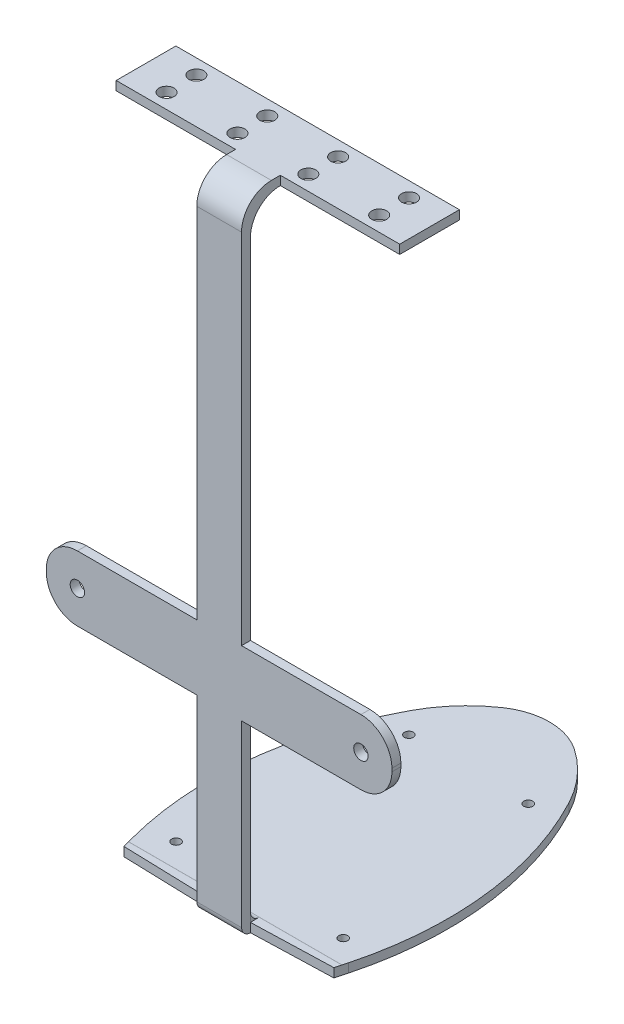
ISO-10303-21;
HEADER;
FILE_DESCRIPTION(('STEP AP214'),'2;1');
FILE_NAME('part.step','',(''),(''),'','','');
FILE_SCHEMA(('AUTOMOTIVE_DESIGN { 1 0 10303 214 1 1 1 1 }'));
ENDSEC;
DATA;
#1=APPLICATION_CONTEXT('core data for automotive mechanical design processes');
#2=APPLICATION_PROTOCOL_DEFINITION('international standard','automotive_design',2000,#1);
#3=PRODUCT_CONTEXT('',#1,'mechanical');
#4=PRODUCT('Part','Part','',(#3));
#5=PRODUCT_RELATED_PRODUCT_CATEGORY('part','',(#4));
#6=PRODUCT_DEFINITION_FORMATION('','',#4);
#7=PRODUCT_DEFINITION_CONTEXT('part definition',#1,'design');
#8=PRODUCT_DEFINITION('design','',#6,#7);
#9=PRODUCT_DEFINITION_SHAPE('','',#8);
#10=(LENGTH_UNIT() NAMED_UNIT(*) SI_UNIT(.MILLI.,.METRE.));
#11=(NAMED_UNIT(*) PLANE_ANGLE_UNIT() SI_UNIT($,.RADIAN.));
#12=(NAMED_UNIT(*) SI_UNIT($,.STERADIAN.) SOLID_ANGLE_UNIT());
#13=UNCERTAINTY_MEASURE_WITH_UNIT(LENGTH_MEASURE(1.E-05),#10,'distance_accuracy_value','');
#14=(GEOMETRIC_REPRESENTATION_CONTEXT(3) GLOBAL_UNCERTAINTY_ASSIGNED_CONTEXT((#13)) GLOBAL_UNIT_ASSIGNED_CONTEXT((#10,
#11,#12)) REPRESENTATION_CONTEXT('',''));
#15=CARTESIAN_POINT('',(0.,0.,0.));
#16=DIRECTION('',(0.,0.,1.));
#17=DIRECTION('',(1.,0.,0.));
#18=AXIS2_PLACEMENT_3D('',#15,#16,#17);
#19=CARTESIAN_POINT('',(10.3890000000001,0.,3.));
#20=DIRECTION('',(0.,1.,0.));
#21=DIRECTION('',(0.,0.,1.));
#22=AXIS2_PLACEMENT_3D('',#19,#20,#21);
#23=PLANE('',#22);
#24=DIRECTION('',(0.,0.,1.));
#25=VECTOR('',#24,1.);
#26=CARTESIAN_POINT('',(65.389,0.,3.));
#27=LINE('',#26,#25);
#28=CARTESIAN_POINT('',(65.389,0.,0.));
#29=VERTEX_POINT('',#28);
#30=CARTESIAN_POINT('',(65.389,0.,3.));
#31=VERTEX_POINT('',#30);
#32=EDGE_CURVE('E606',#29,#31,#27,.T.);
#33=ORIENTED_EDGE('',*,*,#32,.F.);
#34=DIRECTION('',(1.,0.,0.));
#35=VECTOR('',#34,1.);
#36=CARTESIAN_POINT('',(10.3890000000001,0.,0.));
#37=LINE('',#36,#35);
#38=CARTESIAN_POINT('',(105.389,0.,0.));
#39=VERTEX_POINT('',#38);
#40=EDGE_CURVE('E459',#29,#39,#37,.T.);
#41=ORIENTED_EDGE('',*,*,#40,.T.);
#42=DIRECTION('',(0.,0.,-1.));
#43=VECTOR('',#42,1.);
#44=CARTESIAN_POINT('',(105.389,0.,3.));
#45=LINE('',#44,#43);
#46=CARTESIAN_POINT('',(105.389,0.,3.));
#47=VERTEX_POINT('',#46);
#48=EDGE_CURVE('E470',#47,#39,#45,.T.);
#49=ORIENTED_EDGE('',*,*,#48,.F.);
#50=DIRECTION('',(1.,0.,0.));
#51=VECTOR('',#50,1.);
#52=CARTESIAN_POINT('',(10.3890000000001,0.,3.));
#53=LINE('',#52,#51);
#54=EDGE_CURVE('E438',#31,#47,#53,.T.);
#55=ORIENTED_EDGE('',*,*,#54,.F.);
#56=EDGE_LOOP('',(#33,#41,#49,#55));
#57=FACE_BOUND('',#56,.T.);
#58=ADVANCED_FACE('F40',(#57),#23,.F.);
#59=DIRECTION('',(0.,0.,-1.));
#60=VECTOR('',#59,1.);
#61=CARTESIAN_POINT('',(50.389,0.,3.));
#62=LINE('',#61,#60);
#63=CARTESIAN_POINT('',(50.389,0.,3.));
#64=VERTEX_POINT('',#63);
#65=CARTESIAN_POINT('',(50.389,0.,0.));
#66=VERTEX_POINT('',#65);
#67=EDGE_CURVE('E318',#64,#66,#62,.T.);
#68=ORIENTED_EDGE('',*,*,#67,.F.);
#69=CARTESIAN_POINT('',(10.3890000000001,0.,3.));
#70=VERTEX_POINT('',#69);
#71=EDGE_CURVE('E439',#70,#64,#53,.T.);
#72=ORIENTED_EDGE('',*,*,#71,.F.);
#73=DIRECTION('',(0.,0.,-1.));
#74=VECTOR('',#73,1.);
#75=CARTESIAN_POINT('',(10.3890000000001,0.,3.));
#76=LINE('',#75,#74);
#77=CARTESIAN_POINT('',(10.3890000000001,0.,0.));
#78=VERTEX_POINT('',#77);
#79=EDGE_CURVE('E473',#70,#78,#76,.T.);
#80=ORIENTED_EDGE('',*,*,#79,.T.);
#81=EDGE_CURVE('E460',#78,#66,#37,.T.);
#82=ORIENTED_EDGE('',*,*,#81,.T.);
#83=EDGE_LOOP('',(#68,#72,#80,#82));
#84=FACE_BOUND('',#83,.T.);
#85=ADVANCED_FACE('F679',(#84),#23,.F.);
#86=CARTESIAN_POINT('',(50.389,151.821,0.));
#87=DIRECTION('',(1.,0.,0.));
#88=DIRECTION('',(0.,1.,0.));
#89=AXIS2_PLACEMENT_3D('',#86,#87,#88);
#90=PLANE('',#89);
#91=DIRECTION('',(0.,1.,0.));
#92=VECTOR('',#91,1.);
#93=CARTESIAN_POINT('',(50.389,151.821,-10.));
#94=LINE('',#93,#92);
#95=CARTESIAN_POINT('',(50.389,148.821,-10.));
#96=VERTEX_POINT('',#95);
#97=CARTESIAN_POINT('',(50.389,151.821,-10.));
#98=VERTEX_POINT('',#97);
#99=EDGE_CURVE('E367',#96,#98,#94,.T.);
#100=ORIENTED_EDGE('',*,*,#99,.F.);
#101=CARTESIAN_POINT('',(50.389,138.821,-10.));
#102=DIRECTION('',(1.,0.,0.));
#103=DIRECTION('',(0.,1.,0.));
#104=AXIS2_PLACEMENT_3D('',#101,#102,#103);
#105=CIRCLE('',#104,10.);
#106=CARTESIAN_POINT('',(50.389,138.821,0.));
#107=VERTEX_POINT('',#106);
#108=EDGE_CURVE('E503',#96,#107,#105,.T.);
#109=ORIENTED_EDGE('',*,*,#108,.T.);
#110=DIRECTION('',(0.,-1.,0.));
#111=VECTOR('',#110,1.);
#112=CARTESIAN_POINT('',(50.389,151.821,0.));
#113=LINE('',#112,#111);
#114=CARTESIAN_POINT('',(50.389,21.821,0.));
#115=VERTEX_POINT('',#114);
#116=EDGE_CURVE('E419',#107,#115,#113,.T.);
#117=ORIENTED_EDGE('',*,*,#116,.T.);
#118=DIRECTION('',(0.,0.,1.));
#119=VECTOR('',#118,1.);
#120=CARTESIAN_POINT('',(50.389,21.821,0.));
#121=LINE('',#120,#119);
#122=CARTESIAN_POINT('',(50.389,21.821,3.));
#123=VERTEX_POINT('',#122);
#124=EDGE_CURVE('E409',#115,#123,#121,.T.);
#125=ORIENTED_EDGE('',*,*,#124,.T.);
#126=DIRECTION('',(0.,-1.,0.));
#127=VECTOR('',#126,1.);
#128=CARTESIAN_POINT('',(50.389,151.821,3.));
#129=LINE('',#128,#127);
#130=CARTESIAN_POINT('',(50.389,141.821,3.));
#131=VERTEX_POINT('',#130);
#132=EDGE_CURVE('E417',#131,#123,#129,.T.);
#133=ORIENTED_EDGE('',*,*,#132,.F.);
#134=CARTESIAN_POINT('',(50.389,141.821,-7.));
#135=DIRECTION('',(1.,0.,0.));
#136=DIRECTION('',(0.,1.,0.));
#137=AXIS2_PLACEMENT_3D('',#134,#135,#136);
#138=CIRCLE('',#137,10.);
#139=CARTESIAN_POINT('',(50.389,151.821,-7.));
#140=VERTEX_POINT('',#139);
#141=EDGE_CURVE('E500',#131,#140,#138,.F.);
#142=ORIENTED_EDGE('',*,*,#141,.T.);
#143=DIRECTION('',(0.,0.,1.));
#144=VECTOR('',#143,1.);
#145=CARTESIAN_POINT('',(50.389,151.821,0.));
#146=LINE('',#145,#144);
#147=EDGE_CURVE('E408',#98,#140,#146,.T.);
#148=ORIENTED_EDGE('',*,*,#147,.F.);
#149=EDGE_LOOP('',(#100,#109,#117,#125,#133,#142,#148));
#150=FACE_BOUND('',#149,.T.);
#151=ADVANCED_FACE('F655',(#150),#90,.F.);
#152=CARTESIAN_POINT('',(65.389,151.821,0.));
#153=DIRECTION('',(-1.,0.,0.));
#154=DIRECTION('',(0.,-1.,0.));
#155=AXIS2_PLACEMENT_3D('',#152,#153,#154);
#156=PLANE('',#155);
#157=DIRECTION('',(0.,-1.,0.));
#158=VECTOR('',#157,1.);
#159=CARTESIAN_POINT('',(65.389,151.821,-10.));
#160=LINE('',#159,#158);
#161=CARTESIAN_POINT('',(65.389,151.821,-10.));
#162=VERTEX_POINT('',#161);
#163=CARTESIAN_POINT('',(65.389,148.821,-10.));
#164=VERTEX_POINT('',#163);
#165=EDGE_CURVE('E382',#162,#164,#160,.T.);
#166=ORIENTED_EDGE('',*,*,#165,.F.);
#167=DIRECTION('',(0.,0.,-1.));
#168=VECTOR('',#167,1.);
#169=CARTESIAN_POINT('',(65.389,151.821,0.));
#170=LINE('',#169,#168);
#171=CARTESIAN_POINT('',(65.389,151.821,-7.));
#172=VERTEX_POINT('',#171);
#173=EDGE_CURVE('E405',#172,#162,#170,.T.);
#174=ORIENTED_EDGE('',*,*,#173,.F.);
#175=CARTESIAN_POINT('',(65.389,141.821,-7.));
#176=DIRECTION('',(-1.,0.,0.));
#177=DIRECTION('',(0.,-1.,0.));
#178=AXIS2_PLACEMENT_3D('',#175,#176,#177);
#179=CIRCLE('',#178,10.);
#180=CARTESIAN_POINT('',(65.389,141.821,3.));
#181=VERTEX_POINT('',#180);
#182=EDGE_CURVE('E496',#172,#181,#179,.F.);
#183=ORIENTED_EDGE('',*,*,#182,.T.);
#184=DIRECTION('',(0.,-1.,0.));
#185=VECTOR('',#184,1.);
#186=CARTESIAN_POINT('',(65.389,151.821,3.));
#187=LINE('',#186,#185);
#188=CARTESIAN_POINT('',(65.389,21.821,3.));
#189=VERTEX_POINT('',#188);
#190=EDGE_CURVE('E411',#181,#189,#187,.T.);
#191=ORIENTED_EDGE('',*,*,#190,.T.);
#192=DIRECTION('',(0.,0.,-1.));
#193=VECTOR('',#192,1.);
#194=CARTESIAN_POINT('',(65.389,21.821,0.));
#195=LINE('',#194,#193);
#196=CARTESIAN_POINT('',(65.389,21.821,0.));
#197=VERTEX_POINT('',#196);
#198=EDGE_CURVE('E404',#189,#197,#195,.T.);
#199=ORIENTED_EDGE('',*,*,#198,.T.);
#200=DIRECTION('',(0.,-1.,0.));
#201=VECTOR('',#200,1.);
#202=CARTESIAN_POINT('',(65.389,151.821,0.));
#203=LINE('',#202,#201);
#204=CARTESIAN_POINT('',(65.389,138.821,0.));
#205=VERTEX_POINT('',#204);
#206=EDGE_CURVE('E421',#205,#197,#203,.T.);
#207=ORIENTED_EDGE('',*,*,#206,.F.);
#208=CARTESIAN_POINT('',(65.389,138.821,-10.));
#209=DIRECTION('',(-1.,0.,0.));
#210=DIRECTION('',(0.,-1.,0.));
#211=AXIS2_PLACEMENT_3D('',#208,#209,#210);
#212=CIRCLE('',#211,10.);
#213=EDGE_CURVE('E505',#205,#164,#212,.T.);
#214=ORIENTED_EDGE('',*,*,#213,.T.);
#215=EDGE_LOOP('',(#166,#174,#183,#191,#199,#207,#214));
#216=FACE_BOUND('',#215,.T.);
#217=ADVANCED_FACE('F926',(#216),#156,.F.);
#218=CARTESIAN_POINT('',(105.389,11.432,0.));
#219=DIRECTION('',(0.,0.,1.));
#220=DIRECTION('',(1.,0.,0.));
#221=AXIS2_PLACEMENT_3D('',#218,#219,#220);
#222=PLANE('',#221);
#223=CARTESIAN_POINT('',(10.39,10.9105,0.));
#224=DIRECTION('',(0.,0.,-1.));
#225=DIRECTION('',(-1.,0.,0.));
#226=AXIS2_PLACEMENT_3D('',#223,#224,#225);
#227=CIRCLE('',#226,2.41);
#228=CARTESIAN_POINT('',(7.98,10.9105,0.));
#229=VERTEX_POINT('',#228);
#230=EDGE_CURVE('E355',#229,#229,#227,.T.);
#231=ORIENTED_EDGE('',*,*,#230,.F.);
#232=EDGE_LOOP('',(#231));
#233=FACE_BOUND('',#232,.T.);
#234=CARTESIAN_POINT('',(105.388,10.9105,0.));
#235=DIRECTION('',(0.,0.,-1.));
#236=DIRECTION('',(-1.,0.,0.));
#237=AXIS2_PLACEMENT_3D('',#234,#235,#236);
#238=CIRCLE('',#237,2.41);
#239=CARTESIAN_POINT('',(102.978,10.9105,0.));
#240=VERTEX_POINT('',#239);
#241=EDGE_CURVE('E359',#240,#240,#238,.T.);
#242=ORIENTED_EDGE('',*,*,#241,.F.);
#243=EDGE_LOOP('',(#242));
#244=FACE_BOUND('',#243,.T.);
#245=DIRECTION('',(0.,1.,0.));
#246=VECTOR('',#245,1.);
#247=CARTESIAN_POINT('',(65.389,-60.,0.));
#248=LINE('',#247,#246);
#249=CARTESIAN_POINT('',(65.389,-57.,0.));
#250=VERTEX_POINT('',#249);
#251=EDGE_CURVE('E312',#250,#29,#248,.T.);
#252=ORIENTED_EDGE('',*,*,#251,.F.);
#253=DIRECTION('',(1.,0.,0.));
#254=VECTOR('',#253,1.);
#255=CARTESIAN_POINT('',(50.389,-57.,0.));
#256=LINE('',#255,#254);
#257=CARTESIAN_POINT('',(50.389,-57.,0.));
#258=VERTEX_POINT('',#257);
#259=EDGE_CURVE('E303',#250,#258,#256,.F.);
#260=ORIENTED_EDGE('',*,*,#259,.T.);
#261=DIRECTION('',(0.,1.,0.));
#262=VECTOR('',#261,1.);
#263=CARTESIAN_POINT('',(50.389,-60.,0.));
#264=LINE('',#263,#262);
#265=EDGE_CURVE('E309',#258,#66,#264,.T.);
#266=ORIENTED_EDGE('',*,*,#265,.T.);
#267=ORIENTED_EDGE('',*,*,#81,.F.);
#268=CARTESIAN_POINT('',(10.389,10.389,0.));
#269=DIRECTION('',(0.,0.,1.));
#270=DIRECTION('',(-1.,0.,0.));
#271=AXIS2_PLACEMENT_3D('',#268,#269,#270);
#272=CIRCLE('',#271,10.389);
#273=CARTESIAN_POINT('',(0.,10.389,0.));
#274=VERTEX_POINT('',#273);
#275=EDGE_CURVE('E457',#274,#78,#272,.T.);
#276=ORIENTED_EDGE('',*,*,#275,.F.);
#277=DIRECTION('',(0.,-1.,0.));
#278=VECTOR('',#277,1.);
#279=CARTESIAN_POINT('',(0.,11.4319999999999,0.));
#280=LINE('',#279,#278);
#281=CARTESIAN_POINT('',(0.,11.4319999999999,0.));
#282=VERTEX_POINT('',#281);
#283=EDGE_CURVE('E455',#282,#274,#280,.T.);
#284=ORIENTED_EDGE('',*,*,#283,.F.);
#285=CARTESIAN_POINT('',(10.389,11.432,0.));
#286=DIRECTION('',(0.,0.,1.));
#287=DIRECTION('',(1.,0.,0.));
#288=AXIS2_PLACEMENT_3D('',#285,#286,#287);
#289=CIRCLE('',#288,10.389);
#290=CARTESIAN_POINT('',(10.3890000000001,21.821,0.));
#291=VERTEX_POINT('',#290);
#292=EDGE_CURVE('E453',#291,#282,#289,.T.);
#293=ORIENTED_EDGE('',*,*,#292,.F.);
#294=DIRECTION('',(-1.,0.,0.));
#295=VECTOR('',#294,1.);
#296=CARTESIAN_POINT('',(105.389,21.821,0.));
#297=LINE('',#296,#295);
#298=EDGE_CURVE('E449',#115,#291,#297,.T.);
#299=ORIENTED_EDGE('',*,*,#298,.F.);
#300=ORIENTED_EDGE('',*,*,#116,.F.);
#301=DIRECTION('',(-1.,0.,0.));
#302=VECTOR('',#301,1.);
#303=CARTESIAN_POINT('',(65.389,138.821,0.));
#304=LINE('',#303,#302);
#305=EDGE_CURVE('E491',#107,#205,#304,.F.);
#306=ORIENTED_EDGE('',*,*,#305,.T.);
#307=ORIENTED_EDGE('',*,*,#206,.T.);
#308=CARTESIAN_POINT('',(105.389,21.821,0.));
#309=VERTEX_POINT('',#308);
#310=EDGE_CURVE('E450',#309,#197,#297,.T.);
#311=ORIENTED_EDGE('',*,*,#310,.F.);
#312=CARTESIAN_POINT('',(105.389,11.432,0.));
#313=DIRECTION('',(0.,0.,1.));
#314=DIRECTION('',(1.,0.,0.));
#315=AXIS2_PLACEMENT_3D('',#312,#313,#314);
#316=CIRCLE('',#315,10.389);
#317=CARTESIAN_POINT('',(115.778,11.4319999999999,0.));
#318=VERTEX_POINT('',#317);
#319=EDGE_CURVE('E423',#318,#309,#316,.T.);
#320=ORIENTED_EDGE('',*,*,#319,.F.);
#321=DIRECTION('',(0.,1.,0.));
#322=VECTOR('',#321,1.);
#323=CARTESIAN_POINT('',(115.778,10.3890000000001,0.));
#324=LINE('',#323,#322);
#325=CARTESIAN_POINT('',(115.778,10.3890000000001,0.));
#326=VERTEX_POINT('',#325);
#327=EDGE_CURVE('E428',#326,#318,#324,.T.);
#328=ORIENTED_EDGE('',*,*,#327,.F.);
#329=CARTESIAN_POINT('',(105.389,10.389,0.));
#330=DIRECTION('',(0.,0.,1.));
#331=DIRECTION('',(1.,0.,0.));
#332=AXIS2_PLACEMENT_3D('',#329,#330,#331);
#333=CIRCLE('',#332,10.389);
#334=EDGE_CURVE('E462',#39,#326,#333,.T.);
#335=ORIENTED_EDGE('',*,*,#334,.F.);
#336=ORIENTED_EDGE('',*,*,#40,.F.);
#337=EDGE_LOOP('',(#252,#260,#266,#267,#276,#284,#293,#299,#300,#306,#307,#311,#320,#328,#335,#336));
#338=FACE_BOUND('',#337,.T.);
#339=ADVANCED_FACE('F307',(#233,#244,#338),#222,.F.);
#340=CARTESIAN_POINT('',(105.389,21.821,3.));
#341=DIRECTION('',(0.,-1.,0.));
#342=DIRECTION('',(1.,0.,0.));
#343=AXIS2_PLACEMENT_3D('',#340,#341,#342);
#344=PLANE('',#343);
#345=ORIENTED_EDGE('',*,*,#198,.F.);
#346=DIRECTION('',(-1.,0.,0.));
#347=VECTOR('',#346,1.);
#348=CARTESIAN_POINT('',(105.389,21.821,3.));
#349=LINE('',#348,#347);
#350=CARTESIAN_POINT('',(105.389,21.821,3.));
#351=VERTEX_POINT('',#350);
#352=EDGE_CURVE('E429',#351,#189,#349,.T.);
#353=ORIENTED_EDGE('',*,*,#352,.F.);
#354=DIRECTION('',(0.,0.,-1.));
#355=VECTOR('',#354,1.);
#356=CARTESIAN_POINT('',(105.389,21.821,3.));
#357=LINE('',#356,#355);
#358=EDGE_CURVE('E485',#351,#309,#357,.T.);
#359=ORIENTED_EDGE('',*,*,#358,.T.);
#360=ORIENTED_EDGE('',*,*,#310,.T.);
#361=EDGE_LOOP('',(#345,#353,#359,#360));
#362=FACE_BOUND('',#361,.T.);
#363=ADVANCED_FACE('F644',(#362),#344,.F.);
#364=ORIENTED_EDGE('',*,*,#124,.F.);
#365=ORIENTED_EDGE('',*,*,#298,.T.);
#366=DIRECTION('',(0.,0.,-1.));
#367=VECTOR('',#366,1.);
#368=CARTESIAN_POINT('',(10.3890000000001,21.821,3.));
#369=LINE('',#368,#367);
#370=CARTESIAN_POINT('',(10.3890000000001,21.821,3.));
#371=VERTEX_POINT('',#370);
#372=EDGE_CURVE('E482',#371,#291,#369,.T.);
#373=ORIENTED_EDGE('',*,*,#372,.F.);
#374=EDGE_CURVE('E427',#123,#371,#349,.T.);
#375=ORIENTED_EDGE('',*,*,#374,.F.);
#376=EDGE_LOOP('',(#364,#365,#373,#375));
#377=FACE_BOUND('',#376,.T.);
#378=ADVANCED_FACE('F660',(#377),#344,.F.);
#379=CARTESIAN_POINT('',(105.389,11.432,3.));
#380=DIRECTION('',(0.,0.,-1.));
#381=DIRECTION('',(-1.,0.,0.));
#382=AXIS2_PLACEMENT_3D('',#379,#380,#381);
#383=CYLINDRICAL_SURFACE('',#382,10.389);
#384=ORIENTED_EDGE('',*,*,#319,.T.);
#385=ORIENTED_EDGE('',*,*,#358,.F.);
#386=CARTESIAN_POINT('',(105.389,11.432,3.));
#387=DIRECTION('',(0.,0.,1.));
#388=DIRECTION('',(1.,0.,0.));
#389=AXIS2_PLACEMENT_3D('',#386,#387,#388);
#390=CIRCLE('',#389,10.389);
#391=CARTESIAN_POINT('',(115.778,11.4319999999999,3.));
#392=VERTEX_POINT('',#391);
#393=EDGE_CURVE('E424',#392,#351,#390,.T.);
#394=ORIENTED_EDGE('',*,*,#393,.F.);
#395=DIRECTION('',(0.,0.,-1.));
#396=VECTOR('',#395,1.);
#397=CARTESIAN_POINT('',(115.778,11.4319999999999,3.));
#398=LINE('',#397,#396);
#399=EDGE_CURVE('E446',#392,#318,#398,.T.);
#400=ORIENTED_EDGE('',*,*,#399,.T.);
#401=EDGE_LOOP('',(#384,#385,#394,#400));
#402=FACE_BOUND('',#401,.T.);
#403=ADVANCED_FACE('F641',(#402),#383,.T.);
#404=CARTESIAN_POINT('',(10.389,11.432,3.));
#405=DIRECTION('',(0.,0.,-1.));
#406=DIRECTION('',(-1.,0.,0.));
#407=AXIS2_PLACEMENT_3D('',#404,#405,#406);
#408=CYLINDRICAL_SURFACE('',#407,10.389);
#409=ORIENTED_EDGE('',*,*,#292,.T.);
#410=DIRECTION('',(0.,0.,-1.));
#411=VECTOR('',#410,1.);
#412=CARTESIAN_POINT('',(0.,11.4319999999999,3.));
#413=LINE('',#412,#411);
#414=CARTESIAN_POINT('',(0.,11.4319999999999,3.));
#415=VERTEX_POINT('',#414);
#416=EDGE_CURVE('E479',#415,#282,#413,.T.);
#417=ORIENTED_EDGE('',*,*,#416,.F.);
#418=CARTESIAN_POINT('',(10.389,11.432,3.));
#419=DIRECTION('',(0.,0.,1.));
#420=DIRECTION('',(1.,0.,0.));
#421=AXIS2_PLACEMENT_3D('',#418,#419,#420);
#422=CIRCLE('',#421,10.389);
#423=EDGE_CURVE('E432',#371,#415,#422,.T.);
#424=ORIENTED_EDGE('',*,*,#423,.F.);
#425=ORIENTED_EDGE('',*,*,#372,.T.);
#426=EDGE_LOOP('',(#409,#417,#424,#425));
#427=FACE_BOUND('',#426,.T.);
#428=ADVANCED_FACE('F666',(#427),#408,.T.);
#429=CARTESIAN_POINT('',(0.,11.4319999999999,3.));
#430=DIRECTION('',(1.,0.,0.));
#431=DIRECTION('',(0.,1.,0.));
#432=AXIS2_PLACEMENT_3D('',#429,#430,#431);
#433=PLANE('',#432);
#434=ORIENTED_EDGE('',*,*,#283,.T.);
#435=DIRECTION('',(0.,0.,-1.));
#436=VECTOR('',#435,1.);
#437=CARTESIAN_POINT('',(0.,10.389,3.));
#438=LINE('',#437,#436);
#439=CARTESIAN_POINT('',(0.,10.389,3.));
#440=VERTEX_POINT('',#439);
#441=EDGE_CURVE('E476',#440,#274,#438,.T.);
#442=ORIENTED_EDGE('',*,*,#441,.F.);
#443=DIRECTION('',(0.,-1.,0.));
#444=VECTOR('',#443,1.);
#445=CARTESIAN_POINT('',(0.,11.4319999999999,3.));
#446=LINE('',#445,#444);
#447=EDGE_CURVE('E434',#415,#440,#446,.T.);
#448=ORIENTED_EDGE('',*,*,#447,.F.);
#449=ORIENTED_EDGE('',*,*,#416,.T.);
#450=EDGE_LOOP('',(#434,#442,#448,#449));
#451=FACE_BOUND('',#450,.T.);
#452=ADVANCED_FACE('F672',(#451),#433,.F.);
#453=CARTESIAN_POINT('',(10.389,10.389,3.));
#454=DIRECTION('',(0.,0.,-1.));
#455=DIRECTION('',(-1.,0.,0.));
#456=AXIS2_PLACEMENT_3D('',#453,#454,#455);
#457=CYLINDRICAL_SURFACE('',#456,10.389);
#458=ORIENTED_EDGE('',*,*,#275,.T.);
#459=ORIENTED_EDGE('',*,*,#79,.F.);
#460=CARTESIAN_POINT('',(10.389,10.389,3.));
#461=DIRECTION('',(0.,0.,1.));
#462=DIRECTION('',(-1.,0.,0.));
#463=AXIS2_PLACEMENT_3D('',#460,#461,#462);
#464=CIRCLE('',#463,10.389);
#465=EDGE_CURVE('E436',#440,#70,#464,.T.);
#466=ORIENTED_EDGE('',*,*,#465,.F.);
#467=ORIENTED_EDGE('',*,*,#441,.T.);
#468=EDGE_LOOP('',(#458,#459,#466,#467));
#469=FACE_BOUND('',#468,.T.);
#470=ADVANCED_FACE('F676',(#469),#457,.T.);
#471=CARTESIAN_POINT('',(105.389,10.389,3.));
#472=DIRECTION('',(0.,0.,-1.));
#473=DIRECTION('',(-1.,0.,0.));
#474=AXIS2_PLACEMENT_3D('',#471,#472,#473);
#475=CYLINDRICAL_SURFACE('',#474,10.389);
#476=ORIENTED_EDGE('',*,*,#334,.T.);
#477=DIRECTION('',(0.,0.,-1.));
#478=VECTOR('',#477,1.);
#479=CARTESIAN_POINT('',(115.778,10.3890000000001,3.));
#480=LINE('',#479,#478);
#481=CARTESIAN_POINT('',(115.778,10.3890000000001,3.));
#482=VERTEX_POINT('',#481);
#483=EDGE_CURVE('E467',#482,#326,#480,.T.);
#484=ORIENTED_EDGE('',*,*,#483,.F.);
#485=CARTESIAN_POINT('',(105.389,10.389,3.));
#486=DIRECTION('',(0.,0.,1.));
#487=DIRECTION('',(1.,0.,0.));
#488=AXIS2_PLACEMENT_3D('',#485,#486,#487);
#489=CIRCLE('',#488,10.389);
#490=EDGE_CURVE('E442',#47,#482,#489,.T.);
#491=ORIENTED_EDGE('',*,*,#490,.F.);
#492=ORIENTED_EDGE('',*,*,#48,.T.);
#493=EDGE_LOOP('',(#476,#484,#491,#492));
#494=FACE_BOUND('',#493,.T.);
#495=ADVANCED_FACE('F631',(#494),#475,.T.);
#496=CARTESIAN_POINT('',(115.778,10.3890000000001,3.));
#497=DIRECTION('',(-1.,0.,0.));
#498=DIRECTION('',(0.,0.,1.));
#499=AXIS2_PLACEMENT_3D('',#496,#497,#498);
#500=PLANE('',#499);
#501=ORIENTED_EDGE('',*,*,#327,.T.);
#502=ORIENTED_EDGE('',*,*,#399,.F.);
#503=DIRECTION('',(0.,1.,0.));
#504=VECTOR('',#503,1.);
#505=CARTESIAN_POINT('',(115.778,10.3890000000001,3.));
#506=LINE('',#505,#504);
#507=EDGE_CURVE('E444',#482,#392,#506,.T.);
#508=ORIENTED_EDGE('',*,*,#507,.F.);
#509=ORIENTED_EDGE('',*,*,#483,.T.);
#510=EDGE_LOOP('',(#501,#502,#508,#509));
#511=FACE_BOUND('',#510,.T.);
#512=ADVANCED_FACE('F637',(#511),#500,.F.);
#513=CARTESIAN_POINT('',(105.389,11.432,3.));
#514=DIRECTION('',(0.,0.,1.));
#515=DIRECTION('',(1.,0.,0.));
#516=AXIS2_PLACEMENT_3D('',#513,#514,#515);
#517=PLANE('',#516);
#518=CARTESIAN_POINT('',(10.39,10.9105,3.));
#519=DIRECTION('',(0.,0.,1.));
#520=DIRECTION('',(1.,0.,0.));
#521=AXIS2_PLACEMENT_3D('',#518,#519,#520);
#522=CIRCLE('',#521,2.41);
#523=CARTESIAN_POINT('',(12.8,10.9105,3.));
#524=VERTEX_POINT('',#523);
#525=EDGE_CURVE('E378',#524,#524,#522,.T.);
#526=ORIENTED_EDGE('',*,*,#525,.F.);
#527=EDGE_LOOP('',(#526));
#528=FACE_BOUND('',#527,.T.);
#529=CARTESIAN_POINT('',(105.388,10.9105,3.));
#530=DIRECTION('',(0.,0.,1.));
#531=DIRECTION('',(1.,0.,0.));
#532=AXIS2_PLACEMENT_3D('',#529,#530,#531);
#533=CIRCLE('',#532,2.41);
#534=CARTESIAN_POINT('',(107.798,10.9105,3.));
#535=VERTEX_POINT('',#534);
#536=EDGE_CURVE('E358',#535,#535,#533,.T.);
#537=ORIENTED_EDGE('',*,*,#536,.F.);
#538=EDGE_LOOP('',(#537));
#539=FACE_BOUND('',#538,.T.);
#540=ORIENTED_EDGE('',*,*,#190,.F.);
#541=DIRECTION('',(1.,0.,0.));
#542=VECTOR('',#541,1.);
#543=CARTESIAN_POINT('',(105.389,141.821,3.));
#544=LINE('',#543,#542);
#545=EDGE_CURVE('E498',#181,#131,#544,.F.);
#546=ORIENTED_EDGE('',*,*,#545,.T.);
#547=ORIENTED_EDGE('',*,*,#132,.T.);
#548=ORIENTED_EDGE('',*,*,#374,.T.);
#549=ORIENTED_EDGE('',*,*,#423,.T.);
#550=ORIENTED_EDGE('',*,*,#447,.T.);
#551=ORIENTED_EDGE('',*,*,#465,.T.);
#552=ORIENTED_EDGE('',*,*,#71,.T.);
#553=DIRECTION('',(0.,1.,0.));
#554=VECTOR('',#553,1.);
#555=CARTESIAN_POINT('',(50.389,-60.,3.));
#556=LINE('',#555,#554);
#557=CARTESIAN_POINT('',(50.389,-60.,3.));
#558=VERTEX_POINT('',#557);
#559=EDGE_CURVE('E320',#558,#64,#556,.T.);
#560=ORIENTED_EDGE('',*,*,#559,.F.);
#561=DIRECTION('',(-1.,0.,0.));
#562=VECTOR('',#561,1.);
#563=CARTESIAN_POINT('',(50.389,-60.,3.));
#564=LINE('',#563,#562);
#565=CARTESIAN_POINT('',(65.389,-60.,3.));
#566=VERTEX_POINT('',#565);
#567=EDGE_CURVE('E609',#566,#558,#564,.T.);
#568=ORIENTED_EDGE('',*,*,#567,.F.);
#569=DIRECTION('',(0.,1.,0.));
#570=VECTOR('',#569,1.);
#571=CARTESIAN_POINT('',(65.389,-60.,3.));
#572=LINE('',#571,#570);
#573=EDGE_CURVE('E322',#566,#31,#572,.T.);
#574=ORIENTED_EDGE('',*,*,#573,.T.);
#575=ORIENTED_EDGE('',*,*,#54,.T.);
#576=ORIENTED_EDGE('',*,*,#490,.T.);
#577=ORIENTED_EDGE('',*,*,#507,.T.);
#578=ORIENTED_EDGE('',*,*,#393,.T.);
#579=ORIENTED_EDGE('',*,*,#352,.T.);
#580=EDGE_LOOP('',(#540,#546,#547,#548,#549,#550,#551,#552,#560,#568,#574,#575,#576,#577,#578,#579));
#581=FACE_BOUND('',#580,.T.);
#582=ADVANCED_FACE('F624',(#528,#539,#581),#517,.T.);
#583=CARTESIAN_POINT('',(0.,151.821,0.));
#584=DIRECTION('',(0.,1.,0.));
#585=DIRECTION('',(-1.,0.,0.));
#586=AXIS2_PLACEMENT_3D('',#583,#584,#585);
#587=PLANE('',#586);
#588=CARTESIAN_POINT('',(46.014,151.821,-15.));
#589=DIRECTION('',(0.,1.,0.));
#590=DIRECTION('',(1.,0.,0.));
#591=AXIS2_PLACEMENT_3D('',#588,#589,#590);
#592=CIRCLE('',#591,2.5);
#593=CARTESIAN_POINT('',(48.514,151.821,-15.));
#594=VERTEX_POINT('',#593);
#595=EDGE_CURVE('E334',#594,#594,#592,.T.);
#596=ORIENTED_EDGE('',*,*,#595,.F.);
#597=EDGE_LOOP('',(#596));
#598=FACE_BOUND('',#597,.T.);
#599=CARTESIAN_POINT('',(69.764,151.821,-25.));
#600=DIRECTION('',(0.,1.,0.));
#601=DIRECTION('',(1.,0.,0.));
#602=AXIS2_PLACEMENT_3D('',#599,#600,#601);
#603=CIRCLE('',#602,2.5);
#604=CARTESIAN_POINT('',(72.264,151.821,-25.));
#605=VERTEX_POINT('',#604);
#606=EDGE_CURVE('E340',#605,#605,#603,.T.);
#607=ORIENTED_EDGE('',*,*,#606,.F.);
#608=EDGE_LOOP('',(#607));
#609=FACE_BOUND('',#608,.T.);
#610=CARTESIAN_POINT('',(69.764,151.821,-15.));
#611=DIRECTION('',(0.,1.,0.));
#612=DIRECTION('',(-1.,0.,0.));
#613=AXIS2_PLACEMENT_3D('',#610,#611,#612);
#614=CIRCLE('',#613,2.5);
#615=CARTESIAN_POINT('',(67.264,151.821,-15.));
#616=VERTEX_POINT('',#615);
#617=EDGE_CURVE('E343',#616,#616,#614,.T.);
#618=ORIENTED_EDGE('',*,*,#617,.F.);
#619=EDGE_LOOP('',(#618));
#620=FACE_BOUND('',#619,.T.);
#621=CARTESIAN_POINT('',(93.514,151.821,-15.));
#622=DIRECTION('',(0.,1.,0.));
#623=DIRECTION('',(1.,0.,0.));
#624=AXIS2_PLACEMENT_3D('',#621,#622,#623);
#625=CIRCLE('',#624,2.5);
#626=CARTESIAN_POINT('',(96.014,151.821,-15.));
#627=VERTEX_POINT('',#626);
#628=EDGE_CURVE('E346',#627,#627,#625,.T.);
#629=ORIENTED_EDGE('',*,*,#628,.F.);
#630=EDGE_LOOP('',(#629));
#631=FACE_BOUND('',#630,.T.);
#632=CARTESIAN_POINT('',(22.264,151.821,-15.));
#633=DIRECTION('',(0.,1.,0.));
#634=DIRECTION('',(-1.,0.,0.));
#635=AXIS2_PLACEMENT_3D('',#632,#633,#634);
#636=CIRCLE('',#635,2.5);
#637=CARTESIAN_POINT('',(19.764,151.821,-15.));
#638=VERTEX_POINT('',#637);
#639=EDGE_CURVE('E331',#638,#638,#636,.T.);
#640=ORIENTED_EDGE('',*,*,#639,.F.);
#641=EDGE_LOOP('',(#640));
#642=FACE_BOUND('',#641,.T.);
#643=CARTESIAN_POINT('',(22.264,151.821,-25.));
#644=DIRECTION('',(0.,1.,0.));
#645=DIRECTION('',(1.,0.,0.));
#646=AXIS2_PLACEMENT_3D('',#643,#644,#645);
#647=CIRCLE('',#646,2.5);
#648=CARTESIAN_POINT('',(24.764,151.821,-25.));
#649=VERTEX_POINT('',#648);
#650=EDGE_CURVE('E335',#649,#649,#647,.T.);
#651=ORIENTED_EDGE('',*,*,#650,.F.);
#652=EDGE_LOOP('',(#651));
#653=FACE_BOUND('',#652,.T.);
#654=CARTESIAN_POINT('',(46.014,151.821,-25.));
#655=DIRECTION('',(0.,1.,0.));
#656=DIRECTION('',(-1.,0.,0.));
#657=AXIS2_PLACEMENT_3D('',#654,#655,#656);
#658=CIRCLE('',#657,2.5);
#659=CARTESIAN_POINT('',(43.514,151.821,-25.));
#660=VERTEX_POINT('',#659);
#661=EDGE_CURVE('E330',#660,#660,#658,.T.);
#662=ORIENTED_EDGE('',*,*,#661,.F.);
#663=EDGE_LOOP('',(#662));
#664=FACE_BOUND('',#663,.T.);
#665=CARTESIAN_POINT('',(93.514,151.821,-25.));
#666=DIRECTION('',(0.,1.,0.));
#667=DIRECTION('',(-1.,0.,0.));
#668=AXIS2_PLACEMENT_3D('',#665,#666,#667);
#669=CIRCLE('',#668,2.5);
#670=CARTESIAN_POINT('',(91.014,151.821,-25.));
#671=VERTEX_POINT('',#670);
#672=EDGE_CURVE('E349',#671,#671,#669,.T.);
#673=ORIENTED_EDGE('',*,*,#672,.F.);
#674=EDGE_LOOP('',(#673));
#675=FACE_BOUND('',#674,.T.);
#676=DIRECTION('',(1.,0.,0.));
#677=VECTOR('',#676,1.);
#678=CARTESIAN_POINT('',(65.389,151.821,-30.));
#679=LINE('',#678,#677);
#680=CARTESIAN_POINT('',(10.389,151.821,-30.));
#681=VERTEX_POINT('',#680);
#682=CARTESIAN_POINT('',(105.389,151.821,-30.));
#683=VERTEX_POINT('',#682);
#684=EDGE_CURVE('E402',#681,#683,#679,.T.);
#685=ORIENTED_EDGE('',*,*,#684,.F.);
#686=DIRECTION('',(0.,0.,-1.));
#687=VECTOR('',#686,1.);
#688=CARTESIAN_POINT('',(10.389,151.821,-30.));
#689=LINE('',#688,#687);
#690=CARTESIAN_POINT('',(10.389,151.821,-10.));
#691=VERTEX_POINT('',#690);
#692=EDGE_CURVE('E366',#691,#681,#689,.T.);
#693=ORIENTED_EDGE('',*,*,#692,.F.);
#694=DIRECTION('',(1.,0.,0.));
#695=VECTOR('',#694,1.);
#696=CARTESIAN_POINT('',(10.389,151.821,-10.));
#697=LINE('',#696,#695);
#698=EDGE_CURVE('E380',#691,#98,#697,.T.);
#699=ORIENTED_EDGE('',*,*,#698,.T.);
#700=ORIENTED_EDGE('',*,*,#147,.T.);
#701=DIRECTION('',(1.,0.,0.));
#702=VECTOR('',#701,1.);
#703=CARTESIAN_POINT('',(0.,151.821,-7.));
#704=LINE('',#703,#702);
#705=EDGE_CURVE('E493',#140,#172,#704,.T.);
#706=ORIENTED_EDGE('',*,*,#705,.T.);
#707=ORIENTED_EDGE('',*,*,#173,.T.);
#708=DIRECTION('',(-1.,0.,0.));
#709=VECTOR('',#708,1.);
#710=CARTESIAN_POINT('',(105.389,151.821,-10.));
#711=LINE('',#710,#709);
#712=CARTESIAN_POINT('',(105.389,151.821,-10.));
#713=VERTEX_POINT('',#712);
#714=EDGE_CURVE('E394',#713,#162,#711,.T.);
#715=ORIENTED_EDGE('',*,*,#714,.F.);
#716=DIRECTION('',(0.,0.,1.));
#717=VECTOR('',#716,1.);
#718=CARTESIAN_POINT('',(105.389,151.821,-30.));
#719=LINE('',#718,#717);
#720=EDGE_CURVE('E392',#683,#713,#719,.T.);
#721=ORIENTED_EDGE('',*,*,#720,.F.);
#722=EDGE_LOOP('',(#685,#693,#699,#700,#706,#707,#715,#721));
#723=FACE_BOUND('',#722,.T.);
#724=ADVANCED_FACE('F942',(#598,#609,#620,#631,#642,#653,#664,#675,#723),#587,.T.);
#725=CARTESIAN_POINT('',(50.389,148.821,-30.));
#726=DIRECTION('',(0.,1.,0.));
#727=DIRECTION('',(-1.,0.,0.));
#728=AXIS2_PLACEMENT_3D('',#725,#726,#727);
#729=PLANE('',#728);
#730=CARTESIAN_POINT('',(46.014,148.821,-15.));
#731=DIRECTION('',(0.,1.,0.));
#732=DIRECTION('',(-1.,0.,0.));
#733=AXIS2_PLACEMENT_3D('',#730,#731,#732);
#734=CIRCLE('',#733,2.5);
#735=CARTESIAN_POINT('',(43.514,148.821,-15.));
#736=VERTEX_POINT('',#735);
#737=EDGE_CURVE('E362',#736,#736,#734,.T.);
#738=ORIENTED_EDGE('',*,*,#737,.T.);
#739=EDGE_LOOP('',(#738));
#740=FACE_BOUND('',#739,.T.);
#741=CARTESIAN_POINT('',(69.764,148.821,-25.));
#742=DIRECTION('',(0.,1.,0.));
#743=DIRECTION('',(-1.,0.,0.));
#744=AXIS2_PLACEMENT_3D('',#741,#742,#743);
#745=CIRCLE('',#744,2.5);
#746=CARTESIAN_POINT('',(67.264,148.821,-25.));
#747=VERTEX_POINT('',#746);
#748=EDGE_CURVE('E530',#747,#747,#745,.T.);
#749=ORIENTED_EDGE('',*,*,#748,.T.);
#750=EDGE_LOOP('',(#749));
#751=FACE_BOUND('',#750,.T.);
#752=CARTESIAN_POINT('',(69.764,148.821,-15.));
#753=DIRECTION('',(0.,1.,0.));
#754=DIRECTION('',(-1.,0.,0.));
#755=AXIS2_PLACEMENT_3D('',#752,#753,#754);
#756=CIRCLE('',#755,2.5);
#757=CARTESIAN_POINT('',(67.264,148.821,-15.));
#758=VERTEX_POINT('',#757);
#759=EDGE_CURVE('E527',#758,#758,#756,.T.);
#760=ORIENTED_EDGE('',*,*,#759,.T.);
#761=EDGE_LOOP('',(#760));
#762=FACE_BOUND('',#761,.T.);
#763=CARTESIAN_POINT('',(93.514,148.821,-15.));
#764=DIRECTION('',(0.,1.,0.));
#765=DIRECTION('',(-1.,0.,0.));
#766=AXIS2_PLACEMENT_3D('',#763,#764,#765);
#767=CIRCLE('',#766,2.5);
#768=CARTESIAN_POINT('',(91.014,148.821,-15.));
#769=VERTEX_POINT('',#768);
#770=EDGE_CURVE('E524',#769,#769,#767,.T.);
#771=ORIENTED_EDGE('',*,*,#770,.T.);
#772=EDGE_LOOP('',(#771));
#773=FACE_BOUND('',#772,.T.);
#774=CARTESIAN_POINT('',(22.264,148.821,-15.));
#775=DIRECTION('',(0.,1.,0.));
#776=DIRECTION('',(-1.,0.,0.));
#777=AXIS2_PLACEMENT_3D('',#774,#775,#776);
#778=CIRCLE('',#777,2.5);
#779=CARTESIAN_POINT('',(19.764,148.821,-15.));
#780=VERTEX_POINT('',#779);
#781=EDGE_CURVE('E521',#780,#780,#778,.T.);
#782=ORIENTED_EDGE('',*,*,#781,.T.);
#783=EDGE_LOOP('',(#782));
#784=FACE_BOUND('',#783,.T.);
#785=CARTESIAN_POINT('',(22.264,148.821,-25.));
#786=DIRECTION('',(0.,1.,0.));
#787=DIRECTION('',(-1.,0.,0.));
#788=AXIS2_PLACEMENT_3D('',#785,#786,#787);
#789=CIRCLE('',#788,2.5);
#790=CARTESIAN_POINT('',(19.764,148.821,-25.));
#791=VERTEX_POINT('',#790);
#792=EDGE_CURVE('E518',#791,#791,#789,.T.);
#793=ORIENTED_EDGE('',*,*,#792,.T.);
#794=EDGE_LOOP('',(#793));
#795=FACE_BOUND('',#794,.T.);
#796=CARTESIAN_POINT('',(46.014,148.821,-25.));
#797=DIRECTION('',(0.,1.,0.));
#798=DIRECTION('',(-1.,0.,0.));
#799=AXIS2_PLACEMENT_3D('',#796,#797,#798);
#800=CIRCLE('',#799,2.5);
#801=CARTESIAN_POINT('',(43.514,148.821,-25.));
#802=VERTEX_POINT('',#801);
#803=EDGE_CURVE('E515',#802,#802,#800,.T.);
#804=ORIENTED_EDGE('',*,*,#803,.T.);
#805=EDGE_LOOP('',(#804));
#806=FACE_BOUND('',#805,.T.);
#807=CARTESIAN_POINT('',(93.514,148.821,-25.));
#808=DIRECTION('',(0.,1.,0.));
#809=DIRECTION('',(-1.,0.,0.));
#810=AXIS2_PLACEMENT_3D('',#807,#808,#809);
#811=CIRCLE('',#810,2.5);
#812=CARTESIAN_POINT('',(91.014,148.821,-25.));
#813=VERTEX_POINT('',#812);
#814=EDGE_CURVE('E354',#813,#813,#811,.T.);
#815=ORIENTED_EDGE('',*,*,#814,.T.);
#816=EDGE_LOOP('',(#815));
#817=FACE_BOUND('',#816,.T.);
#818=DIRECTION('',(-1.,0.,0.));
#819=VECTOR('',#818,1.);
#820=CARTESIAN_POINT('',(50.389,148.821,-30.));
#821=LINE('',#820,#819);
#822=CARTESIAN_POINT('',(105.389,148.821,-30.));
#823=VERTEX_POINT('',#822);
#824=CARTESIAN_POINT('',(10.389,148.821,-30.));
#825=VERTEX_POINT('',#824);
#826=EDGE_CURVE('E400',#823,#825,#821,.T.);
#827=ORIENTED_EDGE('',*,*,#826,.F.);
#828=DIRECTION('',(0.,0.,-1.));
#829=VECTOR('',#828,1.);
#830=CARTESIAN_POINT('',(105.389,148.821,-10.));
#831=LINE('',#830,#829);
#832=CARTESIAN_POINT('',(105.389,148.821,-10.));
#833=VERTEX_POINT('',#832);
#834=EDGE_CURVE('E386',#833,#823,#831,.T.);
#835=ORIENTED_EDGE('',*,*,#834,.F.);
#836=DIRECTION('',(-1.,0.,0.));
#837=VECTOR('',#836,1.);
#838=CARTESIAN_POINT('',(105.389,148.821,-10.));
#839=LINE('',#838,#837);
#840=EDGE_CURVE('E398',#833,#164,#839,.T.);
#841=ORIENTED_EDGE('',*,*,#840,.T.);
#842=DIRECTION('',(-1.,0.,0.));
#843=VECTOR('',#842,1.);
#844=CARTESIAN_POINT('',(50.389,148.821,-10.));
#845=LINE('',#844,#843);
#846=EDGE_CURVE('E488',#164,#96,#845,.T.);
#847=ORIENTED_EDGE('',*,*,#846,.T.);
#848=DIRECTION('',(1.,0.,0.));
#849=VECTOR('',#848,1.);
#850=CARTESIAN_POINT('',(10.389,148.821,-10.));
#851=LINE('',#850,#849);
#852=CARTESIAN_POINT('',(10.389,148.821,-10.));
#853=VERTEX_POINT('',#852);
#854=EDGE_CURVE('E375',#853,#96,#851,.T.);
#855=ORIENTED_EDGE('',*,*,#854,.F.);
#856=DIRECTION('',(0.,0.,1.));
#857=VECTOR('',#856,1.);
#858=CARTESIAN_POINT('',(10.389,148.821,-10.));
#859=LINE('',#858,#857);
#860=EDGE_CURVE('E373',#825,#853,#859,.T.);
#861=ORIENTED_EDGE('',*,*,#860,.F.);
#862=EDGE_LOOP('',(#827,#835,#841,#847,#855,#861));
#863=FACE_BOUND('',#862,.T.);
#864=ADVANCED_FACE('F950',(#740,#751,#762,#773,#784,#795,#806,#817,#863),#729,.F.);
#865=CARTESIAN_POINT('',(0.,0.,-30.));
#866=DIRECTION('',(0.,0.,1.));
#867=DIRECTION('',(1.,0.,0.));
#868=AXIS2_PLACEMENT_3D('',#865,#866,#867);
#869=PLANE('',#868);
#870=ORIENTED_EDGE('',*,*,#684,.T.);
#871=DIRECTION('',(0.,1.,0.));
#872=VECTOR('',#871,1.);
#873=CARTESIAN_POINT('',(105.389,148.821,-30.));
#874=LINE('',#873,#872);
#875=EDGE_CURVE('E389',#823,#683,#874,.T.);
#876=ORIENTED_EDGE('',*,*,#875,.F.);
#877=ORIENTED_EDGE('',*,*,#826,.T.);
#878=DIRECTION('',(0.,-1.,0.));
#879=VECTOR('',#878,1.);
#880=CARTESIAN_POINT('',(10.389,148.821,-30.));
#881=LINE('',#880,#879);
#882=EDGE_CURVE('E370',#681,#825,#881,.T.);
#883=ORIENTED_EDGE('',*,*,#882,.F.);
#884=EDGE_LOOP('',(#870,#876,#877,#883));
#885=FACE_BOUND('',#884,.T.);
#886=ADVANCED_FACE('F833',(#885),#869,.F.);
#887=CARTESIAN_POINT('',(50.389,138.821,-10.));
#888=DIRECTION('',(1.,0.,0.));
#889=DIRECTION('',(0.,1.,0.));
#890=AXIS2_PLACEMENT_3D('',#887,#888,#889);
#891=CYLINDRICAL_SURFACE('',#890,10.);
#892=ORIENTED_EDGE('',*,*,#213,.F.);
#893=ORIENTED_EDGE('',*,*,#305,.F.);
#894=ORIENTED_EDGE('',*,*,#108,.F.);
#895=ORIENTED_EDGE('',*,*,#846,.F.);
#896=EDGE_LOOP('',(#892,#893,#894,#895));
#897=FACE_BOUND('',#896,.T.);
#898=ADVANCED_FACE('F830',(#897),#891,.F.);
#899=CARTESIAN_POINT('',(0.,141.821,-7.));
#900=DIRECTION('',(1.,0.,0.));
#901=DIRECTION('',(0.,1.,0.));
#902=AXIS2_PLACEMENT_3D('',#899,#900,#901);
#903=CYLINDRICAL_SURFACE('',#902,10.);
#904=ORIENTED_EDGE('',*,*,#141,.F.);
#905=ORIENTED_EDGE('',*,*,#545,.F.);
#906=ORIENTED_EDGE('',*,*,#182,.F.);
#907=ORIENTED_EDGE('',*,*,#705,.F.);
#908=EDGE_LOOP('',(#904,#905,#906,#907));
#909=FACE_BOUND('',#908,.T.);
#910=ADVANCED_FACE('F650',(#909),#903,.T.);
#911=CARTESIAN_POINT('',(105.389,151.821,-10.));
#912=DIRECTION('',(0.,0.,-1.));
#913=DIRECTION('',(-1.,0.,0.));
#914=AXIS2_PLACEMENT_3D('',#911,#912,#913);
#915=PLANE('',#914);
#916=ORIENTED_EDGE('',*,*,#165,.T.);
#917=ORIENTED_EDGE('',*,*,#840,.F.);
#918=DIRECTION('',(0.,-1.,0.));
#919=VECTOR('',#918,1.);
#920=CARTESIAN_POINT('',(105.389,151.821,-10.));
#921=LINE('',#920,#919);
#922=EDGE_CURVE('E383',#713,#833,#921,.T.);
#923=ORIENTED_EDGE('',*,*,#922,.F.);
#924=ORIENTED_EDGE('',*,*,#714,.T.);
#925=EDGE_LOOP('',(#916,#917,#923,#924));
#926=FACE_BOUND('',#925,.T.);
#927=ADVANCED_FACE('F836',(#926),#915,.F.);
#928=CARTESIAN_POINT('',(105.389,0.,0.));
#929=DIRECTION('',(1.,0.,0.));
#930=DIRECTION('',(0.,0.,-1.));
#931=AXIS2_PLACEMENT_3D('',#928,#929,#930);
#932=PLANE('',#931);
#933=ORIENTED_EDGE('',*,*,#922,.T.);
#934=ORIENTED_EDGE('',*,*,#834,.T.);
#935=ORIENTED_EDGE('',*,*,#875,.T.);
#936=ORIENTED_EDGE('',*,*,#720,.T.);
#937=EDGE_LOOP('',(#933,#934,#935,#936));
#938=FACE_BOUND('',#937,.T.);
#939=ADVANCED_FACE('F985',(#938),#932,.T.);
#940=CARTESIAN_POINT('',(10.389,151.821,-10.));
#941=DIRECTION('',(0.,0.,-1.));
#942=DIRECTION('',(-1.,0.,0.));
#943=AXIS2_PLACEMENT_3D('',#940,#941,#942);
#944=PLANE('',#943);
#945=ORIENTED_EDGE('',*,*,#99,.T.);
#946=ORIENTED_EDGE('',*,*,#698,.F.);
#947=DIRECTION('',(0.,1.,0.));
#948=VECTOR('',#947,1.);
#949=CARTESIAN_POINT('',(10.389,151.821,-10.));
#950=LINE('',#949,#948);
#951=EDGE_CURVE('E363',#853,#691,#950,.T.);
#952=ORIENTED_EDGE('',*,*,#951,.F.);
#953=ORIENTED_EDGE('',*,*,#854,.T.);
#954=EDGE_LOOP('',(#945,#946,#952,#953));
#955=FACE_BOUND('',#954,.T.);
#956=ADVANCED_FACE('F993',(#955),#944,.F.);
#957=CARTESIAN_POINT('',(10.389,0.,0.));
#958=DIRECTION('',(1.,0.,0.));
#959=DIRECTION('',(0.,0.,-1.));
#960=AXIS2_PLACEMENT_3D('',#957,#958,#959);
#961=PLANE('',#960);
#962=ORIENTED_EDGE('',*,*,#951,.T.);
#963=ORIENTED_EDGE('',*,*,#692,.T.);
#964=ORIENTED_EDGE('',*,*,#882,.T.);
#965=ORIENTED_EDGE('',*,*,#860,.T.);
#966=EDGE_LOOP('',(#962,#963,#964,#965));
#967=FACE_BOUND('',#966,.T.);
#968=ADVANCED_FACE('F1000',(#967),#961,.F.);
#969=CARTESIAN_POINT('',(105.388,10.9105,10.));
#970=DIRECTION('',(0.,0.,-1.));
#971=DIRECTION('',(-1.,0.,0.));
#972=AXIS2_PLACEMENT_3D('',#969,#970,#971);
#973=CYLINDRICAL_SURFACE('',#972,2.41);
#974=ORIENTED_EDGE('',*,*,#536,.T.);
#975=EDGE_LOOP('',(#974));
#976=FACE_BOUND('',#975,.T.);
#977=ORIENTED_EDGE('',*,*,#241,.T.);
#978=EDGE_LOOP('',(#977));
#979=FACE_BOUND('',#978,.T.);
#980=ADVANCED_FACE('F1008',(#976,#979),#973,.F.);
#981=CARTESIAN_POINT('',(10.39,10.9105,10.));
#982=DIRECTION('',(0.,0.,-1.));
#983=DIRECTION('',(-1.,0.,0.));
#984=AXIS2_PLACEMENT_3D('',#981,#982,#983);
#985=CYLINDRICAL_SURFACE('',#984,2.41);
#986=ORIENTED_EDGE('',*,*,#525,.T.);
#987=EDGE_LOOP('',(#986));
#988=FACE_BOUND('',#987,.T.);
#989=ORIENTED_EDGE('',*,*,#230,.T.);
#990=EDGE_LOOP('',(#989));
#991=FACE_BOUND('',#990,.T.);
#992=ADVANCED_FACE('F1016',(#988,#991),#985,.F.);
#993=CARTESIAN_POINT('',(93.514,141.821,-25.));
#994=DIRECTION('',(0.,1.,0.));
#995=DIRECTION('',(-1.,0.,0.));
#996=AXIS2_PLACEMENT_3D('',#993,#994,#995);
#997=CYLINDRICAL_SURFACE('',#996,2.5);
#998=ORIENTED_EDGE('',*,*,#672,.T.);
#999=EDGE_LOOP('',(#998));
#1000=FACE_BOUND('',#999,.T.);
#1001=ORIENTED_EDGE('',*,*,#814,.F.);
#1002=EDGE_LOOP('',(#1001));
#1003=FACE_BOUND('',#1002,.T.);
#1004=ADVANCED_FACE('F1023',(#1000,#1003),#997,.F.);
#1005=CARTESIAN_POINT('',(46.014,141.821,-25.));
#1006=DIRECTION('',(0.,1.,0.));
#1007=DIRECTION('',(-1.,0.,0.));
#1008=AXIS2_PLACEMENT_3D('',#1005,#1006,#1007);
#1009=CYLINDRICAL_SURFACE('',#1008,2.5);
#1010=ORIENTED_EDGE('',*,*,#661,.T.);
#1011=EDGE_LOOP('',(#1010));
#1012=FACE_BOUND('',#1011,.T.);
#1013=ORIENTED_EDGE('',*,*,#803,.F.);
#1014=EDGE_LOOP('',(#1013));
#1015=FACE_BOUND('',#1014,.T.);
#1016=ADVANCED_FACE('F1030',(#1012,#1015),#1009,.F.);
#1017=CARTESIAN_POINT('',(22.264,141.821,-25.));
#1018=DIRECTION('',(0.,1.,0.));
#1019=DIRECTION('',(-1.,0.,0.));
#1020=AXIS2_PLACEMENT_3D('',#1017,#1018,#1019);
#1021=CYLINDRICAL_SURFACE('',#1020,2.5);
#1022=ORIENTED_EDGE('',*,*,#650,.T.);
#1023=EDGE_LOOP('',(#1022));
#1024=FACE_BOUND('',#1023,.T.);
#1025=ORIENTED_EDGE('',*,*,#792,.F.);
#1026=EDGE_LOOP('',(#1025));
#1027=FACE_BOUND('',#1026,.T.);
#1028=ADVANCED_FACE('F1038',(#1024,#1027),#1021,.F.);
#1029=CARTESIAN_POINT('',(22.264,141.821,-15.));
#1030=DIRECTION('',(0.,1.,0.));
#1031=DIRECTION('',(-1.,0.,0.));
#1032=AXIS2_PLACEMENT_3D('',#1029,#1030,#1031);
#1033=CYLINDRICAL_SURFACE('',#1032,2.5);
#1034=ORIENTED_EDGE('',*,*,#639,.T.);
#1035=EDGE_LOOP('',(#1034));
#1036=FACE_BOUND('',#1035,.T.);
#1037=ORIENTED_EDGE('',*,*,#781,.F.);
#1038=EDGE_LOOP('',(#1037));
#1039=FACE_BOUND('',#1038,.T.);
#1040=ADVANCED_FACE('F1046',(#1036,#1039),#1033,.F.);
#1041=CARTESIAN_POINT('',(93.514,141.821,-15.));
#1042=DIRECTION('',(0.,1.,0.));
#1043=DIRECTION('',(-1.,0.,0.));
#1044=AXIS2_PLACEMENT_3D('',#1041,#1042,#1043);
#1045=CYLINDRICAL_SURFACE('',#1044,2.5);
#1046=ORIENTED_EDGE('',*,*,#628,.T.);
#1047=EDGE_LOOP('',(#1046));
#1048=FACE_BOUND('',#1047,.T.);
#1049=ORIENTED_EDGE('',*,*,#770,.F.);
#1050=EDGE_LOOP('',(#1049));
#1051=FACE_BOUND('',#1050,.T.);
#1052=ADVANCED_FACE('F1054',(#1048,#1051),#1045,.F.);
#1053=CARTESIAN_POINT('',(69.764,141.821,-15.));
#1054=DIRECTION('',(0.,1.,0.));
#1055=DIRECTION('',(-1.,0.,0.));
#1056=AXIS2_PLACEMENT_3D('',#1053,#1054,#1055);
#1057=CYLINDRICAL_SURFACE('',#1056,2.5);
#1058=ORIENTED_EDGE('',*,*,#617,.T.);
#1059=EDGE_LOOP('',(#1058));
#1060=FACE_BOUND('',#1059,.T.);
#1061=ORIENTED_EDGE('',*,*,#759,.F.);
#1062=EDGE_LOOP('',(#1061));
#1063=FACE_BOUND('',#1062,.T.);
#1064=ADVANCED_FACE('F1062',(#1060,#1063),#1057,.F.);
#1065=CARTESIAN_POINT('',(69.764,141.821,-25.));
#1066=DIRECTION('',(0.,1.,0.));
#1067=DIRECTION('',(-1.,0.,0.));
#1068=AXIS2_PLACEMENT_3D('',#1065,#1066,#1067);
#1069=CYLINDRICAL_SURFACE('',#1068,2.5);
#1070=ORIENTED_EDGE('',*,*,#606,.T.);
#1071=EDGE_LOOP('',(#1070));
#1072=FACE_BOUND('',#1071,.T.);
#1073=ORIENTED_EDGE('',*,*,#748,.F.);
#1074=EDGE_LOOP('',(#1073));
#1075=FACE_BOUND('',#1074,.T.);
#1076=ADVANCED_FACE('F1070',(#1072,#1075),#1069,.F.);
#1077=CARTESIAN_POINT('',(46.014,141.821,-15.));
#1078=DIRECTION('',(0.,1.,0.));
#1079=DIRECTION('',(-1.,0.,0.));
#1080=AXIS2_PLACEMENT_3D('',#1077,#1078,#1079);
#1081=CYLINDRICAL_SURFACE('',#1080,2.5);
#1082=ORIENTED_EDGE('',*,*,#595,.T.);
#1083=EDGE_LOOP('',(#1082));
#1084=FACE_BOUND('',#1083,.T.);
#1085=ORIENTED_EDGE('',*,*,#737,.F.);
#1086=EDGE_LOOP('',(#1085));
#1087=FACE_BOUND('',#1086,.T.);
#1088=ADVANCED_FACE('F1078',(#1084,#1087),#1081,.F.);
#1089=CARTESIAN_POINT('',(65.389,-60.,3.));
#1090=DIRECTION('',(-1.,0.,0.));
#1091=DIRECTION('',(0.,0.,1.));
#1092=AXIS2_PLACEMENT_3D('',#1089,#1090,#1091);
#1093=PLANE('',#1092);
#1094=DIRECTION('',(0.,0.,1.));
#1095=VECTOR('',#1094,1.);
#1096=CARTESIAN_POINT('',(65.389,-60.,3.));
#1097=LINE('',#1096,#1095);
#1098=CARTESIAN_POINT('',(65.389,-60.,2.96574283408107));
#1099=VERTEX_POINT('',#1098);
#1100=EDGE_CURVE('E607',#1099,#566,#1097,.T.);
#1101=ORIENTED_EDGE('',*,*,#1100,.F.);
#1102=CARTESIAN_POINT('',(65.389,-60.,-0.0342571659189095));
#1103=DIRECTION('',(-1.,0.,0.));
#1104=DIRECTION('',(0.,0.,1.));
#1105=AXIS2_PLACEMENT_3D('',#1102,#1103,#1104);
#1106=CIRCLE('',#1105,3.);
#1107=CARTESIAN_POINT('',(65.389,-62.9998044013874,0.));
#1108=VERTEX_POINT('',#1107);
#1109=EDGE_CURVE('E542',#1099,#1108,#1106,.F.);
#1110=ORIENTED_EDGE('',*,*,#1109,.T.);
#1111=DIRECTION('',(0.,1.,0.));
#1112=VECTOR('',#1111,1.);
#1113=CARTESIAN_POINT('',(65.389,-63.,0.));
#1114=LINE('',#1113,#1112);
#1115=CARTESIAN_POINT('',(65.389,-59.9999022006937,0.));
#1116=VERTEX_POINT('',#1115);
#1117=EDGE_CURVE('E697',#1108,#1116,#1114,.T.);
#1118=ORIENTED_EDGE('',*,*,#1117,.T.);
#1119=DIRECTION('',(0.,-1.,0.));
#1120=VECTOR('',#1119,1.);
#1121=CARTESIAN_POINT('',(65.389,-57.,0.));
#1122=LINE('',#1121,#1120);
#1123=EDGE_CURVE('E751',#250,#1116,#1122,.T.);
#1124=ORIENTED_EDGE('',*,*,#1123,.F.);
#1125=ORIENTED_EDGE('',*,*,#251,.T.);
#1126=ORIENTED_EDGE('',*,*,#32,.T.);
#1127=ORIENTED_EDGE('',*,*,#573,.F.);
#1128=EDGE_LOOP('',(#1101,#1110,#1118,#1124,#1125,#1126,#1127));
#1129=FACE_BOUND('',#1128,.T.);
#1130=ADVANCED_FACE('F617',(#1129),#1093,.F.);
#1131=CARTESIAN_POINT('',(50.389,-60.,3.));
#1132=DIRECTION('',(1.,0.,0.));
#1133=DIRECTION('',(0.,0.,-1.));
#1134=AXIS2_PLACEMENT_3D('',#1131,#1132,#1133);
#1135=PLANE('',#1134);
#1136=DIRECTION('',(0.,1.,0.));
#1137=VECTOR('',#1136,1.);
#1138=CARTESIAN_POINT('',(50.389,-63.,0.));
#1139=LINE('',#1138,#1137);
#1140=CARTESIAN_POINT('',(50.389,-62.9998044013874,0.));
#1141=VERTEX_POINT('',#1140);
#1142=CARTESIAN_POINT('',(50.389,-59.9999022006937,0.));
#1143=VERTEX_POINT('',#1142);
#1144=EDGE_CURVE('E762',#1141,#1143,#1139,.T.);
#1145=ORIENTED_EDGE('',*,*,#1144,.F.);
#1146=CARTESIAN_POINT('',(50.389,-60.,-0.0342571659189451));
#1147=DIRECTION('',(1.,0.,0.));
#1148=DIRECTION('',(0.,0.,-1.));
#1149=AXIS2_PLACEMENT_3D('',#1146,#1147,#1148);
#1150=CIRCLE('',#1149,3.);
#1151=CARTESIAN_POINT('',(50.389,-60.,2.96574283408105));
#1152=VERTEX_POINT('',#1151);
#1153=EDGE_CURVE('E540',#1141,#1152,#1150,.F.);
#1154=ORIENTED_EDGE('',*,*,#1153,.T.);
#1155=DIRECTION('',(0.,0.,-1.));
#1156=VECTOR('',#1155,1.);
#1157=CARTESIAN_POINT('',(50.389,-60.,3.));
#1158=LINE('',#1157,#1156);
#1159=EDGE_CURVE('E324',#558,#1152,#1158,.T.);
#1160=ORIENTED_EDGE('',*,*,#1159,.F.);
#1161=ORIENTED_EDGE('',*,*,#559,.T.);
#1162=ORIENTED_EDGE('',*,*,#67,.T.);
#1163=ORIENTED_EDGE('',*,*,#265,.F.);
#1164=DIRECTION('',(0.,1.,0.));
#1165=VECTOR('',#1164,1.);
#1166=CARTESIAN_POINT('',(50.389,-59.9999022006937,0.));
#1167=LINE('',#1166,#1165);
#1168=EDGE_CURVE('E290',#1143,#258,#1167,.T.);
#1169=ORIENTED_EDGE('',*,*,#1168,.F.);
#1170=EDGE_LOOP('',(#1145,#1154,#1160,#1161,#1162,#1163,#1169));
#1171=FACE_BOUND('',#1170,.T.);
#1172=ADVANCED_FACE('F316',(#1171),#1135,.F.);
#1173=CARTESIAN_POINT('',(0.,-60.,0.));
#1174=DIRECTION('',(0.,-1.,0.));
#1175=DIRECTION('',(0.,0.,-1.));
#1176=AXIS2_PLACEMENT_3D('',#1173,#1174,#1175);
#1177=PLANE('',#1176);
#1178=DIRECTION('',(-1.,0.,0.));
#1179=VECTOR('',#1178,1.);
#1180=CARTESIAN_POINT('',(0.,-60.,2.96574283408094));
#1181=LINE('',#1180,#1179);
#1182=EDGE_CURVE('E508',#1099,#1152,#1181,.T.);
#1183=ORIENTED_EDGE('',*,*,#1182,.F.);
#1184=ORIENTED_EDGE('',*,*,#1100,.T.);
#1185=ORIENTED_EDGE('',*,*,#567,.T.);
#1186=ORIENTED_EDGE('',*,*,#1159,.T.);
#1187=EDGE_LOOP('',(#1183,#1184,#1185,#1186));
#1188=FACE_BOUND('',#1187,.T.);
#1189=ADVANCED_FACE('F684',(#1188),#1177,.T.);
#1190=CARTESIAN_POINT('',(0.,-60.,0.));
#1191=DIRECTION('',(0.,-1.,0.));
#1192=DIRECTION('',(0.,0.,-1.));
#1193=AXIS2_PLACEMENT_3D('',#1190,#1191,#1192);
#1194=PLANE('',#1193);
#1195=CARTESIAN_POINT('',(37.4752455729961,-60.,-80.990961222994));
#1196=DIRECTION('',(0.,-1.,0.));
#1197=DIRECTION('',(0.,0.,-1.));
#1198=AXIS2_PLACEMENT_3D('',#1195,#1196,#1197);
#1199=CIRCLE('',#1198,1.5);
#1200=CARTESIAN_POINT('',(37.4752455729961,-60.,-82.490961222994));
#1201=VERTEX_POINT('',#1200);
#1202=EDGE_CURVE('E575',#1201,#1201,#1199,.T.);
#1203=ORIENTED_EDGE('',*,*,#1202,.T.);
#1204=EDGE_LOOP('',(#1203));
#1205=FACE_BOUND('',#1204,.T.);
#1206=CARTESIAN_POINT('',(77.4752455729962,-60.,-80.990961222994));
#1207=DIRECTION('',(0.,-1.,0.));
#1208=DIRECTION('',(0.,0.,-1.));
#1209=AXIS2_PLACEMENT_3D('',#1206,#1207,#1208);
#1210=CIRCLE('',#1209,1.5);
#1211=CARTESIAN_POINT('',(77.4752455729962,-60.,-82.490961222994));
#1212=VERTEX_POINT('',#1211);
#1213=EDGE_CURVE('E579',#1212,#1212,#1210,.T.);
#1214=ORIENTED_EDGE('',*,*,#1213,.T.);
#1215=EDGE_LOOP('',(#1214));
#1216=FACE_BOUND('',#1215,.T.);
#1217=CARTESIAN_POINT('',(29.4752455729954,-60.,-10.9909612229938));
#1218=DIRECTION('',(0.,-1.,0.));
#1219=DIRECTION('',(0.,0.,-1.));
#1220=AXIS2_PLACEMENT_3D('',#1217,#1218,#1219);
#1221=CIRCLE('',#1220,1.5);
#1222=CARTESIAN_POINT('',(29.4752455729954,-60.,-12.4909612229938));
#1223=VERTEX_POINT('',#1222);
#1224=EDGE_CURVE('E587',#1223,#1223,#1221,.T.);
#1225=ORIENTED_EDGE('',*,*,#1224,.T.);
#1226=EDGE_LOOP('',(#1225));
#1227=FACE_BOUND('',#1226,.T.);
#1228=CARTESIAN_POINT('',(85.475245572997,-60.,-10.9909612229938));
#1229=DIRECTION('',(0.,-1.,0.));
#1230=DIRECTION('',(0.,0.,-1.));
#1231=AXIS2_PLACEMENT_3D('',#1228,#1229,#1230);
#1232=CIRCLE('',#1231,1.5);
#1233=CARTESIAN_POINT('',(85.475245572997,-60.,-12.4909612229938));
#1234=VERTEX_POINT('',#1233);
#1235=EDGE_CURVE('E590',#1234,#1234,#1232,.T.);
#1236=ORIENTED_EDGE('',*,*,#1235,.T.);
#1237=EDGE_LOOP('',(#1236));
#1238=FACE_BOUND('',#1237,.T.);
#1239=DIRECTION('',(0.2573771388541,0.,0.966311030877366));
#1240=VECTOR('',#1239,1.);
#1241=CARTESIAN_POINT('',(20.8721811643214,-60.,-5.55930968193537));
#1242=LINE('',#1241,#1240);
#1243=CARTESIAN_POINT('',(21.1076053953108,-60.,-4.67541986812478));
#1244=VERTEX_POINT('',#1243);
#1245=CARTESIAN_POINT('',(21.5538538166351,-60.,-3.));
#1246=VERTEX_POINT('',#1245);
#1247=EDGE_CURVE('E693',#1244,#1246,#1242,.T.);
#1248=ORIENTED_EDGE('',*,*,#1247,.T.);
#1249=DIRECTION('',(1.,0.,0.));
#1250=VECTOR('',#1249,1.);
#1251=CARTESIAN_POINT('',(65.389,-60.,-3.));
#1252=LINE('',#1251,#1250);
#1253=CARTESIAN_POINT('',(93.0624123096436,-60.,-3.00000000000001));
#1254=VERTEX_POINT('',#1253);
#1255=EDGE_CURVE('E314',#1246,#1254,#1252,.T.);
#1256=ORIENTED_EDGE('',*,*,#1255,.T.);
#1257=DIRECTION('',(-0.257377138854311,0.,0.96631103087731));
#1258=VECTOR('',#1257,1.);
#1259=CARTESIAN_POINT('',(86.1515606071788,-60.,22.9464856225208));
#1260=LINE('',#1259,#1258);
#1261=CARTESIAN_POINT('',(93.5086607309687,-60.,-4.67541986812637));
#1262=VERTEX_POINT('',#1261);
#1263=EDGE_CURVE('E569',#1262,#1254,#1260,.T.);
#1264=ORIENTED_EDGE('',*,*,#1263,.F.);
#1265=CARTESIAN_POINT('',(-17.6171078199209,-60.,-34.2737908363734));
#1266=DIRECTION('',(0.,-1.,0.));
#1267=DIRECTION('',(0.,0.,-1.));
#1268=AXIS2_PLACEMENT_3D('',#1265,#1266,#1267);
#1269=CIRCLE('',#1268,114.999999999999);
#1270=CARTESIAN_POINT('',(83.9650922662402,-60.,-88.1816439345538));
#1271=VERTEX_POINT('',#1270);
#1272=EDGE_CURVE('E576',#1262,#1271,#1269,.F.);
#1273=ORIENTED_EDGE('',*,*,#1272,.T.);
#1274=CARTESIAN_POINT('',(43.3322122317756,-60.,-66.6185026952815));
#1275=DIRECTION('',(0.,-1.,0.));
#1276=DIRECTION('',(0.,0.,-1.));
#1277=AXIS2_PLACEMENT_3D('',#1274,#1275,#1276);
#1278=CIRCLE('',#1277,46.0000000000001);
#1279=CARTESIAN_POINT('',(69.3339254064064,-60.,-104.564660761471));
#1280=VERTEX_POINT('',#1279);
#1281=EDGE_CURVE('E581',#1271,#1280,#1278,.F.);
#1282=ORIENTED_EDGE('',*,*,#1281,.T.);
#1283=CARTESIAN_POINT('',(57.3081330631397,-60.,-87.0145626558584));
#1284=DIRECTION('',(0.,-1.,0.));
#1285=DIRECTION('',(0.,0.,-1.));
#1286=AXIS2_PLACEMENT_3D('',#1283,#1284,#1285);
#1287=CIRCLE('',#1286,21.2749999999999);
#1288=CARTESIAN_POINT('',(45.282340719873,-60.,-104.564660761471));
#1289=VERTEX_POINT('',#1288);
#1290=EDGE_CURVE('E703',#1289,#1280,#1287,.T.);
#1291=ORIENTED_EDGE('',*,*,#1290,.F.);
#1292=CARTESIAN_POINT('',(71.2840538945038,-60.,-66.6185026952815));
#1293=DIRECTION('',(0.,-1.,0.));
#1294=DIRECTION('',(0.,0.,-1.));
#1295=AXIS2_PLACEMENT_3D('',#1292,#1293,#1294);
#1296=CIRCLE('',#1295,46.0000000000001);
#1297=CARTESIAN_POINT('',(30.6511738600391,-60.,-88.1816439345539));
#1298=VERTEX_POINT('',#1297);
#1299=EDGE_CURVE('E700',#1289,#1298,#1296,.F.);
#1300=ORIENTED_EDGE('',*,*,#1299,.T.);
#1301=CARTESIAN_POINT('',(132.2333739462,-60.,-34.2737908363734));
#1302=DIRECTION('',(0.,-1.,0.));
#1303=DIRECTION('',(0.,0.,-1.));
#1304=AXIS2_PLACEMENT_3D('',#1301,#1302,#1303);
#1305=CIRCLE('',#1304,115.);
#1306=EDGE_CURVE('E696',#1298,#1244,#1305,.F.);
#1307=ORIENTED_EDGE('',*,*,#1306,.T.);
#1308=EDGE_LOOP('',(#1248,#1256,#1264,#1273,#1282,#1291,#1300,#1307));
#1309=FACE_BOUND('',#1308,.T.);
#1310=ADVANCED_FACE('F708',(#1205,#1216,#1227,#1238,#1309),#1194,.F.);
#1311=CARTESIAN_POINT('',(20.8721811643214,-63.,-5.55930968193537));
#1312=DIRECTION('',(-0.966311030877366,0.,0.2573771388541));
#1313=DIRECTION('',(0.2573771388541,0.,0.966311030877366));
#1314=AXIS2_PLACEMENT_3D('',#1311,#1312,#1313);
#1315=PLANE('',#1314);
#1316=DIRECTION('',(0.2573771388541,0.,0.966311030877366));
#1317=VECTOR('',#1316,1.);
#1318=CARTESIAN_POINT('',(20.8721811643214,-59.9999022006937,-5.55930968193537));
#1319=LINE('',#1318,#1317);
#1320=CARTESIAN_POINT('',(21.5603057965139,-59.9999022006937,-2.97577632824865));
#1321=VERTEX_POINT('',#1320);
#1322=CARTESIAN_POINT('',(22.1252180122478,-59.9999022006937,-0.854838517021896));
#1323=VERTEX_POINT('',#1322);
#1324=EDGE_CURVE('E738',#1321,#1323,#1319,.T.);
#1325=ORIENTED_EDGE('',*,*,#1324,.F.);
#1326=CARTESIAN_POINT('',(21.5538538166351,-57.,-3.));
#1327=DIRECTION('',(-0.966311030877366,0.,0.2573771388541));
#1328=DIRECTION('',(-0.2573771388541,0.,-0.966311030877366));
#1329=AXIS2_PLACEMENT_3D('',#1326,#1327,#1328);
#1330=ELLIPSE('',#1329,3.10459045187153,3.);
#1331=EDGE_CURVE('E550',#1321,#1246,#1330,.F.);
#1332=ORIENTED_EDGE('',*,*,#1331,.T.);
#1333=ORIENTED_EDGE('',*,*,#1247,.F.);
#1334=DIRECTION('',(0.,1.,0.));
#1335=VECTOR('',#1334,1.);
#1336=CARTESIAN_POINT('',(21.1076053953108,-63.,-4.67541986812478));
#1337=LINE('',#1336,#1335);
#1338=CARTESIAN_POINT('',(21.1076053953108,-63.,-4.67541986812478));
#1339=VERTEX_POINT('',#1338);
#1340=EDGE_CURVE('E604',#1339,#1244,#1337,.T.);
#1341=ORIENTED_EDGE('',*,*,#1340,.F.);
#1342=DIRECTION('',(0.2573771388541,0.,0.966311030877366));
#1343=VECTOR('',#1342,1.);
#1344=CARTESIAN_POINT('',(20.8721811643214,-63.,-5.55930968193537));
#1345=LINE('',#1344,#1343);
#1346=CARTESIAN_POINT('',(22.1252180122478,-63.,-0.854838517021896));
#1347=VERTEX_POINT('',#1346);
#1348=EDGE_CURVE('E593',#1339,#1347,#1345,.T.);
#1349=ORIENTED_EDGE('',*,*,#1348,.T.);
#1350=DIRECTION('',(0.,1.,0.));
#1351=VECTOR('',#1350,1.);
#1352=CARTESIAN_POINT('',(22.1252180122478,-63.,-0.854838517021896));
#1353=LINE('',#1352,#1351);
#1354=EDGE_CURVE('E740',#1347,#1323,#1353,.T.);
#1355=ORIENTED_EDGE('',*,*,#1354,.T.);
#1356=EDGE_LOOP('',(#1325,#1332,#1333,#1341,#1349,#1355));
#1357=FACE_BOUND('',#1356,.T.);
#1358=ADVANCED_FACE('F736',(#1357),#1315,.T.);
#1359=CARTESIAN_POINT('',(132.2333739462,-63.,-34.2737908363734));
#1360=DIRECTION('',(0.,1.,0.));
#1361=DIRECTION('',(0.,0.,1.));
#1362=AXIS2_PLACEMENT_3D('',#1359,#1360,#1361);
#1363=CYLINDRICAL_SURFACE('',#1362,115.);
#1364=ORIENTED_EDGE('',*,*,#1306,.F.);
#1365=DIRECTION('',(0.,1.,0.));
#1366=VECTOR('',#1365,1.);
#1367=CARTESIAN_POINT('',(30.6511738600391,-63.,-88.1816439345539));
#1368=LINE('',#1367,#1366);
#1369=CARTESIAN_POINT('',(30.6511738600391,-63.,-88.1816439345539));
#1370=VERTEX_POINT('',#1369);
#1371=EDGE_CURVE('E602',#1370,#1298,#1368,.T.);
#1372=ORIENTED_EDGE('',*,*,#1371,.F.);
#1373=CARTESIAN_POINT('',(132.2333739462,-63.,-34.2737908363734));
#1374=DIRECTION('',(0.,-1.,0.));
#1375=DIRECTION('',(0.,0.,-1.));
#1376=AXIS2_PLACEMENT_3D('',#1373,#1374,#1375);
#1377=CIRCLE('',#1376,115.);
#1378=EDGE_CURVE('E731',#1370,#1339,#1377,.F.);
#1379=ORIENTED_EDGE('',*,*,#1378,.T.);
#1380=ORIENTED_EDGE('',*,*,#1340,.T.);
#1381=EDGE_LOOP('',(#1364,#1372,#1379,#1380));
#1382=FACE_BOUND('',#1381,.T.);
#1383=ADVANCED_FACE('F728',(#1382),#1363,.T.);
#1384=CARTESIAN_POINT('',(71.2840538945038,-63.,-66.6185026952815));
#1385=DIRECTION('',(0.,1.,0.));
#1386=DIRECTION('',(0.,0.,1.));
#1387=AXIS2_PLACEMENT_3D('',#1384,#1385,#1386);
#1388=CYLINDRICAL_SURFACE('',#1387,46.0000000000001);
#1389=ORIENTED_EDGE('',*,*,#1299,.F.);
#1390=DIRECTION('',(0.,1.,0.));
#1391=VECTOR('',#1390,1.);
#1392=CARTESIAN_POINT('',(45.282340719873,-63.,-104.564660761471));
#1393=LINE('',#1392,#1391);
#1394=CARTESIAN_POINT('',(45.282340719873,-63.,-104.564660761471));
#1395=VERTEX_POINT('',#1394);
#1396=EDGE_CURVE('E600',#1395,#1289,#1393,.T.);
#1397=ORIENTED_EDGE('',*,*,#1396,.F.);
#1398=CARTESIAN_POINT('',(71.2840538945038,-63.,-66.6185026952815));
#1399=DIRECTION('',(0.,-1.,0.));
#1400=DIRECTION('',(0.,0.,-1.));
#1401=AXIS2_PLACEMENT_3D('',#1398,#1399,#1400);
#1402=CIRCLE('',#1401,46.0000000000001);
#1403=EDGE_CURVE('E724',#1395,#1370,#1402,.F.);
#1404=ORIENTED_EDGE('',*,*,#1403,.T.);
#1405=ORIENTED_EDGE('',*,*,#1371,.T.);
#1406=EDGE_LOOP('',(#1389,#1397,#1404,#1405));
#1407=FACE_BOUND('',#1406,.T.);
#1408=ADVANCED_FACE('F723',(#1407),#1388,.T.);
#1409=CARTESIAN_POINT('',(57.3081330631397,-63.,-87.0145626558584));
#1410=DIRECTION('',(0.,1.,0.));
#1411=DIRECTION('',(0.,0.,1.));
#1412=AXIS2_PLACEMENT_3D('',#1409,#1410,#1411);
#1413=CYLINDRICAL_SURFACE('',#1412,21.2749999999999);
#1414=ORIENTED_EDGE('',*,*,#1290,.T.);
#1415=DIRECTION('',(0.,1.,0.));
#1416=VECTOR('',#1415,1.);
#1417=CARTESIAN_POINT('',(69.3339254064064,-63.,-104.564660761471));
#1418=LINE('',#1417,#1416);
#1419=CARTESIAN_POINT('',(69.3339254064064,-63.,-104.564660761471));
#1420=VERTEX_POINT('',#1419);
#1421=EDGE_CURVE('E598',#1420,#1280,#1418,.T.);
#1422=ORIENTED_EDGE('',*,*,#1421,.F.);
#1423=CARTESIAN_POINT('',(57.3081330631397,-63.,-87.0145626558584));
#1424=DIRECTION('',(0.,-1.,0.));
#1425=DIRECTION('',(0.,0.,-1.));
#1426=AXIS2_PLACEMENT_3D('',#1423,#1424,#1425);
#1427=CIRCLE('',#1426,21.2749999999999);
#1428=EDGE_CURVE('E719',#1395,#1420,#1427,.T.);
#1429=ORIENTED_EDGE('',*,*,#1428,.F.);
#1430=ORIENTED_EDGE('',*,*,#1396,.T.);
#1431=EDGE_LOOP('',(#1414,#1422,#1429,#1430));
#1432=FACE_BOUND('',#1431,.T.);
#1433=ADVANCED_FACE('F718',(#1432),#1413,.T.);
#1434=CARTESIAN_POINT('',(43.3322122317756,-63.,-66.6185026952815));
#1435=DIRECTION('',(0.,1.,0.));
#1436=DIRECTION('',(0.,0.,1.));
#1437=AXIS2_PLACEMENT_3D('',#1434,#1435,#1436);
#1438=CYLINDRICAL_SURFACE('',#1437,46.0000000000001);
#1439=ORIENTED_EDGE('',*,*,#1281,.F.);
#1440=DIRECTION('',(0.,1.,0.));
#1441=VECTOR('',#1440,1.);
#1442=CARTESIAN_POINT('',(83.9650922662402,-63.,-88.1816439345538));
#1443=LINE('',#1442,#1441);
#1444=CARTESIAN_POINT('',(83.9650922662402,-63.,-88.1816439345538));
#1445=VERTEX_POINT('',#1444);
#1446=EDGE_CURVE('E595',#1445,#1271,#1443,.T.);
#1447=ORIENTED_EDGE('',*,*,#1446,.F.);
#1448=CARTESIAN_POINT('',(43.3322122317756,-63.,-66.6185026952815));
#1449=DIRECTION('',(0.,-1.,0.));
#1450=DIRECTION('',(0.,0.,-1.));
#1451=AXIS2_PLACEMENT_3D('',#1448,#1449,#1450);
#1452=CIRCLE('',#1451,46.0000000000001);
#1453=EDGE_CURVE('E715',#1445,#1420,#1452,.F.);
#1454=ORIENTED_EDGE('',*,*,#1453,.T.);
#1455=ORIENTED_EDGE('',*,*,#1421,.T.);
#1456=EDGE_LOOP('',(#1439,#1447,#1454,#1455));
#1457=FACE_BOUND('',#1456,.T.);
#1458=ADVANCED_FACE('F711',(#1457),#1438,.T.);
#1459=CARTESIAN_POINT('',(-17.6171078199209,-63.,-34.2737908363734));
#1460=DIRECTION('',(0.,1.,0.));
#1461=DIRECTION('',(0.,0.,1.));
#1462=AXIS2_PLACEMENT_3D('',#1459,#1460,#1461);
#1463=CYLINDRICAL_SURFACE('',#1462,114.999999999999);
#1464=ORIENTED_EDGE('',*,*,#1272,.F.);
#1465=DIRECTION('',(0.,1.,0.));
#1466=VECTOR('',#1465,1.);
#1467=CARTESIAN_POINT('',(93.5086607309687,-63.,-4.67541986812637));
#1468=LINE('',#1467,#1466);
#1469=CARTESIAN_POINT('',(93.5086607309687,-63.,-4.67541986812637));
#1470=VERTEX_POINT('',#1469);
#1471=EDGE_CURVE('E571',#1470,#1262,#1468,.T.);
#1472=ORIENTED_EDGE('',*,*,#1471,.F.);
#1473=CARTESIAN_POINT('',(-17.6171078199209,-63.,-34.2737908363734));
#1474=DIRECTION('',(0.,-1.,0.));
#1475=DIRECTION('',(0.,0.,-1.));
#1476=AXIS2_PLACEMENT_3D('',#1473,#1474,#1475);
#1477=CIRCLE('',#1476,114.999999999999);
#1478=EDGE_CURVE('E775',#1470,#1445,#1477,.F.);
#1479=ORIENTED_EDGE('',*,*,#1478,.T.);
#1480=ORIENTED_EDGE('',*,*,#1446,.T.);
#1481=EDGE_LOOP('',(#1464,#1472,#1479,#1480));
#1482=FACE_BOUND('',#1481,.T.);
#1483=ADVANCED_FACE('F1150',(#1482),#1463,.T.);
#1484=CARTESIAN_POINT('',(29.4752455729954,-63.,-10.9909612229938));
#1485=DIRECTION('',(0.,1.,0.));
#1486=DIRECTION('',(0.,0.,1.));
#1487=AXIS2_PLACEMENT_3D('',#1484,#1485,#1486);
#1488=CYLINDRICAL_SURFACE('',#1487,1.5);
#1489=CARTESIAN_POINT('',(29.4752455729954,-63.,-10.9909612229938));
#1490=DIRECTION('',(0.,-1.,0.));
#1491=DIRECTION('',(0.,0.,-1.));
#1492=AXIS2_PLACEMENT_3D('',#1489,#1490,#1491);
#1493=CIRCLE('',#1492,1.5);
#1494=CARTESIAN_POINT('',(29.4752455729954,-63.,-12.4909612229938));
#1495=VERTEX_POINT('',#1494);
#1496=EDGE_CURVE('E786',#1495,#1495,#1493,.T.);
#1497=ORIENTED_EDGE('',*,*,#1496,.T.);
#1498=EDGE_LOOP('',(#1497));
#1499=FACE_BOUND('',#1498,.T.);
#1500=ORIENTED_EDGE('',*,*,#1224,.F.);
#1501=EDGE_LOOP('',(#1500));
#1502=FACE_BOUND('',#1501,.T.);
#1503=ADVANCED_FACE('F1140',(#1499,#1502),#1488,.F.);
#1504=CARTESIAN_POINT('',(77.4752455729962,-63.,-80.990961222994));
#1505=DIRECTION('',(0.,1.,0.));
#1506=DIRECTION('',(0.,0.,1.));
#1507=AXIS2_PLACEMENT_3D('',#1504,#1505,#1506);
#1508=CYLINDRICAL_SURFACE('',#1507,1.5);
#1509=CARTESIAN_POINT('',(77.4752455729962,-63.,-80.990961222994));
#1510=DIRECTION('',(0.,-1.,0.));
#1511=DIRECTION('',(0.,0.,-1.));
#1512=AXIS2_PLACEMENT_3D('',#1509,#1510,#1511);
#1513=CIRCLE('',#1512,1.5);
#1514=CARTESIAN_POINT('',(77.4752455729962,-63.,-82.490961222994));
#1515=VERTEX_POINT('',#1514);
#1516=EDGE_CURVE('E784',#1515,#1515,#1513,.T.);
#1517=ORIENTED_EDGE('',*,*,#1516,.T.);
#1518=EDGE_LOOP('',(#1517));
#1519=FACE_BOUND('',#1518,.T.);
#1520=ORIENTED_EDGE('',*,*,#1213,.F.);
#1521=EDGE_LOOP('',(#1520));
#1522=FACE_BOUND('',#1521,.T.);
#1523=ADVANCED_FACE('F1130',(#1519,#1522),#1508,.F.);
#1524=CARTESIAN_POINT('',(37.4752455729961,-63.,-80.990961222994));
#1525=DIRECTION('',(0.,1.,0.));
#1526=DIRECTION('',(0.,0.,1.));
#1527=AXIS2_PLACEMENT_3D('',#1524,#1525,#1526);
#1528=CYLINDRICAL_SURFACE('',#1527,1.5);
#1529=CARTESIAN_POINT('',(37.4752455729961,-63.,-80.990961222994));
#1530=DIRECTION('',(0.,-1.,0.));
#1531=DIRECTION('',(0.,0.,-1.));
#1532=AXIS2_PLACEMENT_3D('',#1529,#1530,#1531);
#1533=CIRCLE('',#1532,1.5);
#1534=CARTESIAN_POINT('',(37.4752455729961,-63.,-82.490961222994));
#1535=VERTEX_POINT('',#1534);
#1536=EDGE_CURVE('E781',#1535,#1535,#1533,.T.);
#1537=ORIENTED_EDGE('',*,*,#1536,.T.);
#1538=EDGE_LOOP('',(#1537));
#1539=FACE_BOUND('',#1538,.T.);
#1540=ORIENTED_EDGE('',*,*,#1202,.F.);
#1541=EDGE_LOOP('',(#1540));
#1542=FACE_BOUND('',#1541,.T.);
#1543=ADVANCED_FACE('F1125',(#1539,#1542),#1528,.F.);
#1544=CARTESIAN_POINT('',(86.1515606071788,-63.,22.9464856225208));
#1545=DIRECTION('',(-0.96631103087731,0.,-0.257377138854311));
#1546=DIRECTION('',(-0.257377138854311,0.,0.96631103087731));
#1547=AXIS2_PLACEMENT_3D('',#1544,#1545,#1546);
#1548=PLANE('',#1547);
#1549=DIRECTION('',(0.,-1.,0.));
#1550=VECTOR('',#1549,1.);
#1551=CARTESIAN_POINT('',(92.9383292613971,-63.,-2.53413570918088));
#1552=LINE('',#1551,#1550);
#1553=CARTESIAN_POINT('',(92.9383292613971,-59.9636076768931,-2.53413570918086));
#1554=VERTEX_POINT('',#1553);
#1555=CARTESIAN_POINT('',(92.9383292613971,-59.9999022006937,-2.53413570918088));
#1556=VERTEX_POINT('',#1555);
#1557=EDGE_CURVE('E567',#1554,#1556,#1552,.T.);
#1558=ORIENTED_EDGE('',*,*,#1557,.T.);
#1559=DIRECTION('',(-0.257377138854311,0.,0.96631103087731));
#1560=VECTOR('',#1559,1.);
#1561=CARTESIAN_POINT('',(86.1515606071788,-59.9999022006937,22.9464856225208));
#1562=LINE('',#1561,#1560);
#1563=CARTESIAN_POINT('',(92.4910481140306,-59.9999022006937,-0.85483851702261));
#1564=VERTEX_POINT('',#1563);
#1565=EDGE_CURVE('E744',#1556,#1564,#1562,.T.);
#1566=ORIENTED_EDGE('',*,*,#1565,.T.);
#1567=DIRECTION('',(0.,1.,0.));
#1568=VECTOR('',#1567,1.);
#1569=CARTESIAN_POINT('',(92.4910481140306,-63.,-0.854838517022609));
#1570=LINE('',#1569,#1568);
#1571=CARTESIAN_POINT('',(92.4910481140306,-63.,-0.854838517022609));
#1572=VERTEX_POINT('',#1571);
#1573=EDGE_CURVE('E761',#1572,#1564,#1570,.T.);
#1574=ORIENTED_EDGE('',*,*,#1573,.F.);
#1575=DIRECTION('',(-0.257377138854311,0.,0.96631103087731));
#1576=VECTOR('',#1575,1.);
#1577=CARTESIAN_POINT('',(86.1515606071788,-63.,22.9464856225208));
#1578=LINE('',#1577,#1576);
#1579=EDGE_CURVE('E778',#1470,#1572,#1578,.T.);
#1580=ORIENTED_EDGE('',*,*,#1579,.F.);
#1581=ORIENTED_EDGE('',*,*,#1471,.T.);
#1582=ORIENTED_EDGE('',*,*,#1263,.T.);
#1583=CARTESIAN_POINT('',(93.0624123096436,-57.,-3.));
#1584=DIRECTION('',(-0.96631103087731,0.,-0.257377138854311));
#1585=DIRECTION('',(-0.257377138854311,0.,0.96631103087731));
#1586=AXIS2_PLACEMENT_3D('',#1583,#1584,#1585);
#1587=ELLIPSE('',#1586,3.10459045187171,3.);
#1588=EDGE_CURVE('E313',#1254,#1554,#1587,.T.);
#1589=ORIENTED_EDGE('',*,*,#1588,.T.);
#1590=EDGE_LOOP('',(#1558,#1566,#1574,#1580,#1581,#1582,#1589));
#1591=FACE_BOUND('',#1590,.T.);
#1592=ADVANCED_FACE('F566',(#1591),#1548,.F.);
#1593=CARTESIAN_POINT('',(85.475245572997,-63.,-10.9909612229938));
#1594=DIRECTION('',(0.,1.,0.));
#1595=DIRECTION('',(0.,0.,1.));
#1596=AXIS2_PLACEMENT_3D('',#1593,#1594,#1595);
#1597=CYLINDRICAL_SURFACE('',#1596,1.5);
#1598=CARTESIAN_POINT('',(85.475245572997,-63.,-10.9909612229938));
#1599=DIRECTION('',(0.,-1.,0.));
#1600=DIRECTION('',(0.,0.,-1.));
#1601=AXIS2_PLACEMENT_3D('',#1598,#1599,#1600);
#1602=CIRCLE('',#1601,1.5);
#1603=CARTESIAN_POINT('',(85.475245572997,-63.,-12.4909612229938));
#1604=VERTEX_POINT('',#1603);
#1605=EDGE_CURVE('E596',#1604,#1604,#1602,.T.);
#1606=ORIENTED_EDGE('',*,*,#1605,.T.);
#1607=EDGE_LOOP('',(#1606));
#1608=FACE_BOUND('',#1607,.T.);
#1609=ORIENTED_EDGE('',*,*,#1235,.F.);
#1610=EDGE_LOOP('',(#1609));
#1611=FACE_BOUND('',#1610,.T.);
#1612=ADVANCED_FACE('F793',(#1608,#1611),#1597,.F.);
#1613=CARTESIAN_POINT('',(0.,-63.,0.));
#1614=DIRECTION('',(0.,-1.,0.));
#1615=DIRECTION('',(0.,0.,-1.));
#1616=AXIS2_PLACEMENT_3D('',#1613,#1614,#1615);
#1617=PLANE('',#1616);
#1618=DIRECTION('',(-0.999502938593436,0.,0.0315257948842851));
#1619=VECTOR('',#1618,1.);
#1620=CARTESIAN_POINT('',(65.389,-63.,0.));
#1621=LINE('',#1620,#1619);
#1622=CARTESIAN_POINT('',(66.4750991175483,-63.,-0.0342571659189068));
#1623=VERTEX_POINT('',#1622);
#1624=EDGE_CURVE('E758',#1572,#1623,#1621,.T.);
#1625=ORIENTED_EDGE('',*,*,#1624,.T.);
#1626=DIRECTION('',(-1.,0.,0.));
#1627=VECTOR('',#1626,1.);
#1628=CARTESIAN_POINT('',(50.389,-63.,-0.0342571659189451));
#1629=LINE('',#1628,#1627);
#1630=CARTESIAN_POINT('',(49.2563450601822,-63.,-0.0342571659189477));
#1631=VERTEX_POINT('',#1630);
#1632=EDGE_CURVE('E535',#1623,#1631,#1629,.T.);
#1633=ORIENTED_EDGE('',*,*,#1632,.T.);
#1634=DIRECTION('',(-0.999542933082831,0.,-0.0302311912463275));
#1635=VECTOR('',#1634,1.);
#1636=CARTESIAN_POINT('',(50.389,-63.,0.));
#1637=LINE('',#1636,#1635);
#1638=EDGE_CURVE('E757',#1631,#1347,#1637,.T.);
#1639=ORIENTED_EDGE('',*,*,#1638,.T.);
#1640=ORIENTED_EDGE('',*,*,#1348,.F.);
#1641=ORIENTED_EDGE('',*,*,#1378,.F.);
#1642=ORIENTED_EDGE('',*,*,#1403,.F.);
#1643=ORIENTED_EDGE('',*,*,#1428,.T.);
#1644=ORIENTED_EDGE('',*,*,#1453,.F.);
#1645=ORIENTED_EDGE('',*,*,#1478,.F.);
#1646=ORIENTED_EDGE('',*,*,#1579,.T.);
#1647=EDGE_LOOP('',(#1625,#1633,#1639,#1640,#1641,#1642,#1643,#1644,#1645,#1646));
#1648=FACE_BOUND('',#1647,.T.);
#1649=ORIENTED_EDGE('',*,*,#1536,.F.);
#1650=EDGE_LOOP('',(#1649));
#1651=FACE_BOUND('',#1650,.T.);
#1652=ORIENTED_EDGE('',*,*,#1516,.F.);
#1653=EDGE_LOOP('',(#1652));
#1654=FACE_BOUND('',#1653,.T.);
#1655=ORIENTED_EDGE('',*,*,#1496,.F.);
#1656=EDGE_LOOP('',(#1655));
#1657=FACE_BOUND('',#1656,.T.);
#1658=ORIENTED_EDGE('',*,*,#1605,.F.);
#1659=EDGE_LOOP('',(#1658));
#1660=FACE_BOUND('',#1659,.T.);
#1661=ADVANCED_FACE('F796',(#1648,#1651,#1654,#1657,#1660),#1617,.T.);
#1662=CARTESIAN_POINT('',(50.389,-63.,0.));
#1663=DIRECTION('',(0.0302311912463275,0.,-0.999542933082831));
#1664=DIRECTION('',(-0.999542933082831,0.,-0.0302311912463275));
#1665=AXIS2_PLACEMENT_3D('',#1662,#1663,#1664);
#1666=PLANE('',#1665);
#1667=ORIENTED_EDGE('',*,*,#1144,.T.);
#1668=DIRECTION('',(0.999542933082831,0.,0.0302311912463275));
#1669=VECTOR('',#1668,1.);
#1670=CARTESIAN_POINT('',(20.4027120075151,-59.9999022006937,-0.906935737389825));
#1671=LINE('',#1670,#1669);
#1672=EDGE_CURVE('E297',#1323,#1143,#1671,.T.);
#1673=ORIENTED_EDGE('',*,*,#1672,.F.);
#1674=ORIENTED_EDGE('',*,*,#1354,.F.);
#1675=ORIENTED_EDGE('',*,*,#1638,.F.);
#1676=CARTESIAN_POINT('',(49.2563450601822,-60.,-0.0342571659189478));
#1677=DIRECTION('',(0.0302311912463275,0.,-0.999542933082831));
#1678=DIRECTION('',(0.999542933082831,0.,0.0302311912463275));
#1679=AXIS2_PLACEMENT_3D('',#1676,#1677,#1678);
#1680=ELLIPSE('',#1679,99.2352559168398,3.);
#1681=EDGE_CURVE('E538',#1631,#1141,#1680,.F.);
#1682=ORIENTED_EDGE('',*,*,#1681,.T.);
#1683=EDGE_LOOP('',(#1667,#1673,#1674,#1675,#1682));
#1684=FACE_BOUND('',#1683,.T.);
#1685=ADVANCED_FACE('F798',(#1684),#1666,.F.);
#1686=CARTESIAN_POINT('',(65.389,-63.,0.));
#1687=DIRECTION('',(-0.0315257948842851,0.,-0.999502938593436));
#1688=DIRECTION('',(-0.999502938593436,0.,0.0315257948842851));
#1689=AXIS2_PLACEMENT_3D('',#1686,#1687,#1688);
#1690=PLANE('',#1689);
#1691=ORIENTED_EDGE('',*,*,#1573,.T.);
#1692=DIRECTION('',(0.999502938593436,0.,-0.0315257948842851));
#1693=VECTOR('',#1692,1.);
#1694=CARTESIAN_POINT('',(65.389,-59.9999022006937,0.));
#1695=LINE('',#1694,#1693);
#1696=EDGE_CURVE('E753',#1116,#1564,#1695,.T.);
#1697=ORIENTED_EDGE('',*,*,#1696,.F.);
#1698=ORIENTED_EDGE('',*,*,#1117,.F.);
#1699=CARTESIAN_POINT('',(66.4750991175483,-60.,-0.0342571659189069));
#1700=DIRECTION('',(-0.0315257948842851,0.,-0.999502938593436));
#1701=DIRECTION('',(0.999502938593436,0.,-0.0315257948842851));
#1702=AXIS2_PLACEMENT_3D('',#1699,#1700,#1701);
#1703=ELLIPSE('',#1702,95.1601699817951,3.);
#1704=EDGE_CURVE('E544',#1108,#1623,#1703,.F.);
#1705=ORIENTED_EDGE('',*,*,#1704,.T.);
#1706=ORIENTED_EDGE('',*,*,#1624,.F.);
#1707=EDGE_LOOP('',(#1691,#1697,#1698,#1705,#1706));
#1708=FACE_BOUND('',#1707,.T.);
#1709=ADVANCED_FACE('F805',(#1708),#1690,.F.);
#1710=CARTESIAN_POINT('',(0.,-60.,-0.0342571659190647));
#1711=DIRECTION('',(1.,0.,0.));
#1712=DIRECTION('',(0.,0.,-1.));
#1713=AXIS2_PLACEMENT_3D('',#1710,#1711,#1712);
#1714=CYLINDRICAL_SURFACE('',#1713,3.);
#1715=ORIENTED_EDGE('',*,*,#1109,.F.);
#1716=ORIENTED_EDGE('',*,*,#1182,.T.);
#1717=ORIENTED_EDGE('',*,*,#1153,.F.);
#1718=ORIENTED_EDGE('',*,*,#1681,.F.);
#1719=ORIENTED_EDGE('',*,*,#1632,.F.);
#1720=ORIENTED_EDGE('',*,*,#1704,.F.);
#1721=EDGE_LOOP('',(#1715,#1716,#1717,#1718,#1719,#1720));
#1722=FACE_BOUND('',#1721,.T.);
#1723=ADVANCED_FACE('F687',(#1722),#1714,.T.);
#1724=CARTESIAN_POINT('',(0.,-57.,-3.));
#1725=DIRECTION('',(-1.,0.,0.));
#1726=DIRECTION('',(0.,0.,1.));
#1727=AXIS2_PLACEMENT_3D('',#1724,#1725,#1726);
#1728=CYLINDRICAL_SURFACE('',#1727,3.);
#1729=DIRECTION('',(-1.,0.,0.));
#1730=VECTOR('',#1729,1.);
#1731=CARTESIAN_POINT('',(0.,-59.9999022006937,-2.97577632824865));
#1732=LINE('',#1731,#1730);
#1733=CARTESIAN_POINT('',(50.4790024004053,-59.9999022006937,-2.97577632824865));
#1734=VERTEX_POINT('',#1733);
#1735=EDGE_CURVE('E48',#1321,#1734,#1732,.F.);
#1736=ORIENTED_EDGE('',*,*,#1735,.T.);
#1737=CARTESIAN_POINT('',(50.4797350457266,-57.,-3.));
#1738=DIRECTION('',(0.999542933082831,0.,0.0302311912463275));
#1739=DIRECTION('',(-0.0302311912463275,1.53028060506E-13,0.999542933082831));
#1740=AXIS2_PLACEMENT_3D('',#1737,#1738,#1739);
#1741=ELLIPSE('',#1740,3.0013718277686,3.);
#1742=EDGE_CURVE('E11',#1734,#258,#1741,.F.);
#1743=ORIENTED_EDGE('',*,*,#1742,.T.);
#1744=ORIENTED_EDGE('',*,*,#259,.F.);
#1745=CARTESIAN_POINT('',(65.2943755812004,-57.,-3.));
#1746=DIRECTION('',(-0.999502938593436,0.,0.0315257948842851));
#1747=DIRECTION('',(-0.0315257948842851,0.,-0.999502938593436));
#1748=AXIS2_PLACEMENT_3D('',#1745,#1746,#1747);
#1749=ELLIPSE('',#1748,3.00149192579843,3.);
#1750=CARTESIAN_POINT('',(65.2951396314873,-59.9999022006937,-2.9757763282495));
#1751=VERTEX_POINT('',#1750);
#1752=EDGE_CURVE('E552',#250,#1751,#1749,.F.);
#1753=ORIENTED_EDGE('',*,*,#1752,.T.);
#1754=DIRECTION('',(-1.,0.,0.));
#1755=VECTOR('',#1754,1.);
#1756=CARTESIAN_POINT('',(0.,-59.9999022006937,-2.97577632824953));
#1757=LINE('',#1756,#1755);
#1758=CARTESIAN_POINT('',(92.9243992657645,-59.9999022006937,-2.97577632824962));
#1759=VERTEX_POINT('',#1758);
#1760=EDGE_CURVE('E554',#1751,#1759,#1757,.F.);
#1761=ORIENTED_EDGE('',*,*,#1760,.T.);
#1762=CARTESIAN_POINT('',(92.9236352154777,-57.,-3.));
#1763=DIRECTION('',(0.999502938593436,0.,-0.0315257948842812));
#1764=DIRECTION('',(-0.0315257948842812,0.,-0.999502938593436));
#1765=AXIS2_PLACEMENT_3D('',#1762,#1763,#1764);
#1766=ELLIPSE('',#1765,3.00149192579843,3.);
#1767=EDGE_CURVE('E556',#1759,#1554,#1766,.F.);
#1768=ORIENTED_EDGE('',*,*,#1767,.T.);
#1769=ORIENTED_EDGE('',*,*,#1588,.F.);
#1770=ORIENTED_EDGE('',*,*,#1255,.F.);
#1771=ORIENTED_EDGE('',*,*,#1331,.F.);
#1772=EDGE_LOOP('',(#1736,#1743,#1744,#1753,#1761,#1768,#1769,#1770,#1771));
#1773=FACE_BOUND('',#1772,.T.);
#1774=ADVANCED_FACE('F42',(#1773),#1728,.F.);
#1775=CARTESIAN_POINT('',(65.1998452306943,-59.9999022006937,-5.99701763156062));
#1776=DIRECTION('',(0.,-1.,0.));
#1777=DIRECTION('',(0.,0.,-1.));
#1778=AXIS2_PLACEMENT_3D('',#1775,#1776,#1777);
#1779=PLANE('',#1778);
#1780=DIRECTION('',(0.0315257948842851,0.,0.999502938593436));
#1781=VECTOR('',#1780,1.);
#1782=CARTESIAN_POINT('',(65.1998452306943,-59.9999022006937,-5.99701763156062));
#1783=LINE('',#1782,#1781);
#1784=EDGE_CURVE('E63',#1751,#1116,#1783,.T.);
#1785=ORIENTED_EDGE('',*,*,#1784,.T.);
#1786=ORIENTED_EDGE('',*,*,#1696,.T.);
#1787=ORIENTED_EDGE('',*,*,#1565,.F.);
#1788=DIRECTION('',(0.0315257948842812,0.,0.999502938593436));
#1789=VECTOR('',#1788,1.);
#1790=CARTESIAN_POINT('',(92.9907995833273,-59.9999022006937,-0.870601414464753));
#1791=LINE('',#1790,#1789);
#1792=EDGE_CURVE('E742',#1759,#1556,#1791,.T.);
#1793=ORIENTED_EDGE('',*,*,#1792,.F.);
#1794=ORIENTED_EDGE('',*,*,#1760,.F.);
#1795=EDGE_LOOP('',(#1785,#1786,#1787,#1793,#1794));
#1796=FACE_BOUND('',#1795,.T.);
#1797=ADVANCED_FACE('F842',(#1796),#1779,.F.);
#1798=CARTESIAN_POINT('',(65.1998452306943,-57.,-5.99701763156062));
#1799=DIRECTION('',(-0.999502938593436,0.,0.0315257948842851));
#1800=DIRECTION('',(0.0315257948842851,0.,0.999502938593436));
#1801=AXIS2_PLACEMENT_3D('',#1798,#1799,#1800);
#1802=PLANE('',#1801);
#1803=ORIENTED_EDGE('',*,*,#1123,.T.);
#1804=ORIENTED_EDGE('',*,*,#1784,.F.);
#1805=ORIENTED_EDGE('',*,*,#1752,.F.);
#1806=EDGE_LOOP('',(#1803,#1804,#1805));
#1807=FACE_BOUND('',#1806,.T.);
#1808=ADVANCED_FACE('F848',(#1807),#1802,.F.);
#1809=CARTESIAN_POINT('',(92.9258110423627,0.,-2.93101695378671));
#1810=DIRECTION('',(0.999502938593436,0.,-0.0315257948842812));
#1811=DIRECTION('',(-0.0315257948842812,0.,-0.999502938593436));
#1812=AXIS2_PLACEMENT_3D('',#1809,#1810,#1811);
#1813=PLANE('',#1812);
#1814=ORIENTED_EDGE('',*,*,#1767,.F.);
#1815=ORIENTED_EDGE('',*,*,#1792,.T.);
#1816=ORIENTED_EDGE('',*,*,#1557,.F.);
#1817=EDGE_LOOP('',(#1814,#1815,#1816));
#1818=FACE_BOUND('',#1817,.T.);
#1819=ADVANCED_FACE('F851',(#1818),#1813,.F.);
#1820=CARTESIAN_POINT('',(51.9005595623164,-59.9999022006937,-49.9771466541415));
#1821=DIRECTION('',(0.999542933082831,0.,0.0302311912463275));
#1822=DIRECTION('',(0.0302311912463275,0.,-0.999542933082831));
#1823=AXIS2_PLACEMENT_3D('',#1820,#1821,#1822);
#1824=PLANE('',#1823);
#1825=DIRECTION('',(-0.0302311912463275,0.,0.999542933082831));
#1826=VECTOR('',#1825,1.);
#1827=CARTESIAN_POINT('',(51.9005595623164,-59.9999022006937,-49.9771466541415));
#1828=LINE('',#1827,#1826);
#1829=EDGE_CURVE('E55',#1734,#1143,#1828,.T.);
#1830=ORIENTED_EDGE('',*,*,#1829,.T.);
#1831=ORIENTED_EDGE('',*,*,#1168,.T.);
#1832=ORIENTED_EDGE('',*,*,#1742,.F.);
#1833=EDGE_LOOP('',(#1830,#1831,#1832));
#1834=FACE_BOUND('',#1833,.T.);
#1835=ADVANCED_FACE('F291',(#1834),#1824,.F.);
#1836=CARTESIAN_POINT('',(21.9142715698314,-59.9999022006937,-50.8840823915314));
#1837=DIRECTION('',(0.,-1.,0.));
#1838=DIRECTION('',(0.,0.,-1.));
#1839=AXIS2_PLACEMENT_3D('',#1836,#1837,#1838);
#1840=PLANE('',#1839);
#1841=ORIENTED_EDGE('',*,*,#1324,.T.);
#1842=ORIENTED_EDGE('',*,*,#1672,.T.);
#1843=ORIENTED_EDGE('',*,*,#1829,.F.);
#1844=ORIENTED_EDGE('',*,*,#1735,.F.);
#1845=EDGE_LOOP('',(#1841,#1842,#1843,#1844));
#1846=FACE_BOUND('',#1845,.T.);
#1847=ADVANCED_FACE('F859',(#1846),#1840,.F.);
#1848=CLOSED_SHELL('',(#58,#85,#151,#217,#339,#363,#378,#403,#428,#452,#470,#495,#512,#582,#724,
#864,#886,#898,#910,#927,#939,#956,#968,#980,#992,#1004,#1016,#1028,#1040,#1052,#1064,#1076,
#1088,#1130,#1172,#1189,#1310,#1358,#1383,#1408,#1433,#1458,#1483,#1503,#1523,#1543,#1592,#1612,
#1661,#1685,#1709,#1723,#1774,#1797,#1808,#1819,#1835,#1847));
#1849=MANIFOLD_SOLID_BREP('B2',#1848);
#1850=ADVANCED_BREP_SHAPE_REPRESENTATION('',(#18,#1849),#14);
#1851=SHAPE_DEFINITION_REPRESENTATION(#9,#1850);
ENDSEC;
END-ISO-10303-21;
